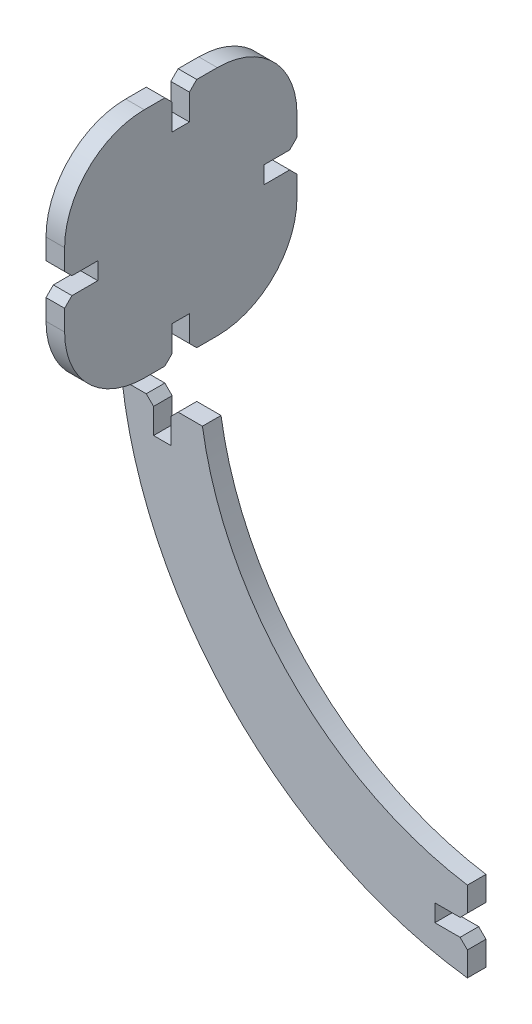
ISO-10303-21;
HEADER;
FILE_DESCRIPTION(('STEP AP214'),'2;1');
FILE_NAME('part.step','',(''),(''),'','','');
FILE_SCHEMA(('AUTOMOTIVE_DESIGN { 1 0 10303 214 1 1 1 1 }'));
ENDSEC;
DATA;
#1=APPLICATION_CONTEXT('core data for automotive mechanical design processes');
#2=APPLICATION_PROTOCOL_DEFINITION('international standard','automotive_design',2000,#1);
#3=PRODUCT_CONTEXT('',#1,'mechanical');
#4=PRODUCT('Part','Part','',(#3));
#5=PRODUCT_RELATED_PRODUCT_CATEGORY('part','',(#4));
#6=PRODUCT_DEFINITION_FORMATION('','',#4);
#7=PRODUCT_DEFINITION_CONTEXT('part definition',#1,'design');
#8=PRODUCT_DEFINITION('design','',#6,#7);
#9=PRODUCT_DEFINITION_SHAPE('','',#8);
#10=(LENGTH_UNIT() NAMED_UNIT(*) SI_UNIT(.MILLI.,.METRE.));
#11=(NAMED_UNIT(*) PLANE_ANGLE_UNIT() SI_UNIT($,.RADIAN.));
#12=(NAMED_UNIT(*) SI_UNIT($,.STERADIAN.) SOLID_ANGLE_UNIT());
#13=UNCERTAINTY_MEASURE_WITH_UNIT(LENGTH_MEASURE(1.E-05),#10,'distance_accuracy_value','');
#14=(GEOMETRIC_REPRESENTATION_CONTEXT(3) GLOBAL_UNCERTAINTY_ASSIGNED_CONTEXT((#13)) GLOBAL_UNIT_ASSIGNED_CONTEXT((#10,
#11,#12)) REPRESENTATION_CONTEXT('',''));
#15=CARTESIAN_POINT('',(0.,0.,0.));
#16=DIRECTION('',(0.,0.,1.));
#17=DIRECTION('',(1.,0.,0.));
#18=AXIS2_PLACEMENT_3D('',#15,#16,#17);
#19=CARTESIAN_POINT('',(-7.49999999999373,-75.9999999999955,-20.9830787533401));
#20=DIRECTION('',(-1.,0.,0.));
#21=DIRECTION('',(0.,-1.,0.));
#22=AXIS2_PLACEMENT_3D('',#19,#20,#21);
#23=PLANE('',#22);
#24=DIRECTION('',(0.,-1.,0.));
#25=VECTOR('',#24,1.);
#26=CARTESIAN_POINT('',(-7.49999999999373,-75.9999999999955,1.4));
#27=LINE('',#26,#25);
#28=CARTESIAN_POINT('',(-7.49999999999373,-63.4104418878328,1.4));
#29=VERTEX_POINT('',#28);
#30=CARTESIAN_POINT('',(-7.49999999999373,-67.0699231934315,1.4));
#31=VERTEX_POINT('',#30);
#32=EDGE_CURVE('E298',#29,#31,#27,.T.);
#33=ORIENTED_EDGE('',*,*,#32,.T.);
#34=DIRECTION('',(0.,0.,-1.));
#35=VECTOR('',#34,1.);
#36=CARTESIAN_POINT('',(-7.49999999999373,-67.0699231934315,-20.9830787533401));
#37=LINE('',#36,#35);
#38=CARTESIAN_POINT('',(-7.49999999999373,-67.0699231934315,-1.4));
#39=VERTEX_POINT('',#38);
#40=EDGE_CURVE('E151',#31,#39,#37,.T.);
#41=ORIENTED_EDGE('',*,*,#40,.T.);
#42=DIRECTION('',(0.,1.,0.));
#43=VECTOR('',#42,1.);
#44=CARTESIAN_POINT('',(-7.49999999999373,-75.9999999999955,-1.4));
#45=LINE('',#44,#43);
#46=CARTESIAN_POINT('',(-7.50000000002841,-63.4104418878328,-1.4));
#47=VERTEX_POINT('',#46);
#48=EDGE_CURVE('E261',#39,#47,#45,.T.);
#49=ORIENTED_EDGE('',*,*,#48,.T.);
#50=DIRECTION('',(0.,0.,1.));
#51=VECTOR('',#50,1.);
#52=CARTESIAN_POINT('',(-7.49999999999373,-63.4104418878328,-20.9830787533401));
#53=LINE('',#52,#51);
#54=EDGE_CURVE('E292',#47,#29,#53,.T.);
#55=ORIENTED_EDGE('',*,*,#54,.T.);
#56=EDGE_LOOP('',(#33,#41,#49,#55));
#57=FACE_BOUND('',#56,.T.);
#58=ADVANCED_FACE('F52',(#57),#23,.F.);
#59=CARTESIAN_POINT('',(-60.,-23.5,-20.9830787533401));
#60=DIRECTION('',(0.,-1.,0.));
#61=DIRECTION('',(0.,0.,-1.));
#62=AXIS2_PLACEMENT_3D('',#59,#60,#61);
#63=PLANE('',#62);
#64=DIRECTION('',(1.,0.,0.));
#65=VECTOR('',#64,1.);
#66=CARTESIAN_POINT('',(-60.,-23.5,1.4));
#67=LINE('',#66,#65);
#68=CARTESIAN_POINT('',(-59.5294044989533,-23.5,1.4));
#69=VERTEX_POINT('',#68);
#70=CARTESIAN_POINT('',(-55.8699231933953,-23.5,1.4));
#71=VERTEX_POINT('',#70);
#72=EDGE_CURVE('E171',#69,#71,#67,.T.);
#73=ORIENTED_EDGE('',*,*,#72,.T.);
#74=DIRECTION('',(0.,0.,-1.));
#75=VECTOR('',#74,1.);
#76=CARTESIAN_POINT('',(-55.8699231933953,-23.5,-20.9830787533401));
#77=LINE('',#76,#75);
#78=CARTESIAN_POINT('',(-55.8699231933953,-23.5,-1.4));
#79=VERTEX_POINT('',#78);
#80=EDGE_CURVE('E163',#71,#79,#77,.T.);
#81=ORIENTED_EDGE('',*,*,#80,.T.);
#82=DIRECTION('',(-1.,0.,0.));
#83=VECTOR('',#82,1.);
#84=CARTESIAN_POINT('',(-60.,-23.5,-1.4));
#85=LINE('',#84,#83);
#86=CARTESIAN_POINT('',(-59.5294044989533,-23.5,-1.4));
#87=VERTEX_POINT('',#86);
#88=EDGE_CURVE('E168',#79,#87,#85,.T.);
#89=ORIENTED_EDGE('',*,*,#88,.T.);
#90=DIRECTION('',(0.,0.,-1.));
#91=VECTOR('',#90,1.);
#92=CARTESIAN_POINT('',(-59.5294044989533,-23.5,1.4));
#93=LINE('',#92,#91);
#94=EDGE_CURVE('E252',#69,#87,#93,.T.);
#95=ORIENTED_EDGE('',*,*,#94,.F.);
#96=EDGE_LOOP('',(#73,#81,#89,#95));
#97=FACE_BOUND('',#96,.T.);
#98=ADVANCED_FACE('F165',(#97),#63,.F.);
#99=CARTESIAN_POINT('',(0.,-16.,1.4));
#100=DIRECTION('',(0.,0.,-1.));
#101=DIRECTION('',(-1.,0.,0.));
#102=AXIS2_PLACEMENT_3D('',#99,#100,#101);
#103=CYLINDRICAL_SURFACE('',#102,48.);
#104=DIRECTION('',(0.,0.,1.));
#105=VECTOR('',#104,1.);
#106=CARTESIAN_POINT('',(-47.4104418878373,-23.5,-20.9830787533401));
#107=LINE('',#106,#105);
#108=CARTESIAN_POINT('',(-47.4104418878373,-23.5,-1.4));
#109=VERTEX_POINT('',#108);
#110=CARTESIAN_POINT('',(-47.4104418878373,-23.5,1.4));
#111=VERTEX_POINT('',#110);
#112=EDGE_CURVE('E239',#109,#111,#107,.T.);
#113=ORIENTED_EDGE('',*,*,#112,.T.);
#114=CARTESIAN_POINT('',(0.,-16.,1.4));
#115=DIRECTION('',(0.,0.,1.));
#116=DIRECTION('',(1.,0.,0.));
#117=AXIS2_PLACEMENT_3D('',#114,#115,#116);
#118=CIRCLE('',#117,48.);
#119=EDGE_CURVE('E244',#111,#29,#118,.T.);
#120=ORIENTED_EDGE('',*,*,#119,.T.);
#121=ORIENTED_EDGE('',*,*,#54,.F.);
#122=CARTESIAN_POINT('',(0.,-16.,-1.4));
#123=DIRECTION('',(0.,0.,1.));
#124=DIRECTION('',(1.,0.,0.));
#125=AXIS2_PLACEMENT_3D('',#122,#123,#124);
#126=CIRCLE('',#125,48.);
#127=EDGE_CURVE('E262',#109,#47,#126,.T.);
#128=ORIENTED_EDGE('',*,*,#127,.F.);
#129=EDGE_LOOP('',(#113,#120,#121,#128));
#130=FACE_BOUND('',#129,.T.);
#131=ADVANCED_FACE('F321',(#130),#103,.F.);
#132=CARTESIAN_POINT('',(0.,-16.,1.4));
#133=DIRECTION('',(0.,0.,-1.));
#134=DIRECTION('',(-1.,0.,0.));
#135=AXIS2_PLACEMENT_3D('',#132,#133,#134);
#136=CYLINDRICAL_SURFACE('',#135,60.);
#137=CARTESIAN_POINT('',(0.,-16.,1.4));
#138=DIRECTION('',(0.,0.,1.));
#139=DIRECTION('',(1.,0.,0.));
#140=AXIS2_PLACEMENT_3D('',#137,#138,#139);
#141=CIRCLE('',#140,60.);
#142=CARTESIAN_POINT('',(-7.49999999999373,-75.5294044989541,1.4));
#143=VERTEX_POINT('',#142);
#144=EDGE_CURVE('E258',#69,#143,#141,.T.);
#145=ORIENTED_EDGE('',*,*,#144,.F.);
#146=ORIENTED_EDGE('',*,*,#94,.T.);
#147=CARTESIAN_POINT('',(0.,-16.,-1.4));
#148=DIRECTION('',(0.,0.,1.));
#149=DIRECTION('',(1.,0.,0.));
#150=AXIS2_PLACEMENT_3D('',#147,#148,#149);
#151=CIRCLE('',#150,60.);
#152=CARTESIAN_POINT('',(-7.49999999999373,-75.5294044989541,-1.4));
#153=VERTEX_POINT('',#152);
#154=EDGE_CURVE('E184',#87,#153,#151,.T.);
#155=ORIENTED_EDGE('',*,*,#154,.T.);
#156=DIRECTION('',(0.,0.,-1.));
#157=VECTOR('',#156,1.);
#158=CARTESIAN_POINT('',(-7.49999999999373,-75.5294044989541,1.4));
#159=LINE('',#158,#157);
#160=EDGE_CURVE('E265',#153,#143,#159,.F.);
#161=ORIENTED_EDGE('',*,*,#160,.T.);
#162=EDGE_LOOP('',(#145,#146,#155,#161));
#163=FACE_BOUND('',#162,.T.);
#164=ADVANCED_FACE('F306',(#163),#136,.T.);
#165=CARTESIAN_POINT('',(0.,-16.,-1.4));
#166=DIRECTION('',(0.,0.,1.));
#167=DIRECTION('',(1.,0.,0.));
#168=AXIS2_PLACEMENT_3D('',#165,#166,#167);
#169=PLANE('',#168);
#170=DIRECTION('',(-1.,0.,0.));
#171=VECTOR('',#170,1.);
#172=CARTESIAN_POINT('',(-7.49999999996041,-70.7699231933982,-1.4));
#173=LINE('',#172,#171);
#174=CARTESIAN_POINT('',(-8.59999999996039,-70.7699231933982,-1.4));
#175=VERTEX_POINT('',#174);
#176=CARTESIAN_POINT('',(-12.3999999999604,-70.7699231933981,-1.4));
#177=VERTEX_POINT('',#176);
#178=EDGE_CURVE('E228',#175,#177,#173,.T.);
#179=ORIENTED_EDGE('',*,*,#178,.F.);
#180=DIRECTION('',(-0.707106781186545,0.707106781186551,0.));
#181=VECTOR('',#180,1.);
#182=CARTESIAN_POINT('',(-7.49999999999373,-71.8699231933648,-1.4));
#183=LINE('',#182,#181);
#184=CARTESIAN_POINT('',(-7.49999999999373,-71.8699231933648,-1.4));
#185=VERTEX_POINT('',#184);
#186=EDGE_CURVE('E191',#175,#185,#183,.F.);
#187=ORIENTED_EDGE('',*,*,#186,.T.);
#188=EDGE_CURVE('E286',#153,#185,#45,.T.);
#189=ORIENTED_EDGE('',*,*,#188,.F.);
#190=ORIENTED_EDGE('',*,*,#154,.F.);
#191=ORIENTED_EDGE('',*,*,#88,.F.);
#192=DIRECTION('',(-0.707106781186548,0.707106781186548,0.));
#193=VECTOR('',#192,1.);
#194=CARTESIAN_POINT('',(-54.8699231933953,-24.5,-1.4));
#195=LINE('',#194,#193);
#196=CARTESIAN_POINT('',(-54.7699231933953,-24.6,-1.4));
#197=VERTEX_POINT('',#196);
#198=EDGE_CURVE('E180',#79,#197,#195,.F.);
#199=ORIENTED_EDGE('',*,*,#198,.T.);
#200=DIRECTION('',(0.,1.,0.));
#201=VECTOR('',#200,1.);
#202=CARTESIAN_POINT('',(-54.7699231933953,-28.5,-1.4));
#203=LINE('',#202,#201);
#204=CARTESIAN_POINT('',(-54.7699231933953,-28.4,-1.4));
#205=VERTEX_POINT('',#204);
#206=EDGE_CURVE('E205',#205,#197,#203,.T.);
#207=ORIENTED_EDGE('',*,*,#206,.F.);
#208=DIRECTION('',(-1.,0.,0.));
#209=VECTOR('',#208,1.);
#210=CARTESIAN_POINT('',(-54.8699231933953,-28.4,-1.4));
#211=LINE('',#210,#209);
#212=CARTESIAN_POINT('',(-52.1699231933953,-28.4,-1.4));
#213=VERTEX_POINT('',#212);
#214=EDGE_CURVE('E209',#213,#205,#211,.T.);
#215=ORIENTED_EDGE('',*,*,#214,.F.);
#216=DIRECTION('',(0.,-1.,0.));
#217=VECTOR('',#216,1.);
#218=CARTESIAN_POINT('',(-52.1699231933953,-28.5,-1.4));
#219=LINE('',#218,#217);
#220=CARTESIAN_POINT('',(-52.1699231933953,-24.6,-1.4));
#221=VERTEX_POINT('',#220);
#222=EDGE_CURVE('E211',#221,#213,#219,.T.);
#223=ORIENTED_EDGE('',*,*,#222,.F.);
#224=DIRECTION('',(-0.70710678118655,-0.707106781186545,0.));
#225=VECTOR('',#224,1.);
#226=CARTESIAN_POINT('',(-51.0699231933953,-23.5,-1.4));
#227=LINE('',#226,#225);
#228=CARTESIAN_POINT('',(-51.0699231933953,-23.5,-1.4));
#229=VERTEX_POINT('',#228);
#230=EDGE_CURVE('E71',#221,#229,#227,.F.);
#231=ORIENTED_EDGE('',*,*,#230,.T.);
#232=EDGE_CURVE('E185',#109,#229,#85,.T.);
#233=ORIENTED_EDGE('',*,*,#232,.F.);
#234=ORIENTED_EDGE('',*,*,#127,.T.);
#235=ORIENTED_EDGE('',*,*,#48,.F.);
#236=DIRECTION('',(0.707106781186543,0.707106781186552,0.));
#237=VECTOR('',#236,1.);
#238=CARTESIAN_POINT('',(-8.49999999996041,-68.0699231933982,-1.4));
#239=LINE('',#238,#237);
#240=CARTESIAN_POINT('',(-8.59999999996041,-68.1699231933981,-1.4));
#241=VERTEX_POINT('',#240);
#242=EDGE_CURVE('E156',#39,#241,#239,.F.);
#243=ORIENTED_EDGE('',*,*,#242,.T.);
#244=DIRECTION('',(1.,0.,0.));
#245=VECTOR('',#244,1.);
#246=CARTESIAN_POINT('',(-7.49999999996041,-68.1699231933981,-1.4));
#247=LINE('',#246,#245);
#248=CARTESIAN_POINT('',(-12.3999999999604,-68.1699231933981,-1.4));
#249=VERTEX_POINT('',#248);
#250=EDGE_CURVE('E229',#249,#241,#247,.T.);
#251=ORIENTED_EDGE('',*,*,#250,.F.);
#252=DIRECTION('',(0.,1.,0.));
#253=VECTOR('',#252,1.);
#254=CARTESIAN_POINT('',(-12.3999999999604,-68.0699231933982,-1.4));
#255=LINE('',#254,#253);
#256=EDGE_CURVE('E219',#177,#249,#255,.T.);
#257=ORIENTED_EDGE('',*,*,#256,.F.);
#258=EDGE_LOOP('',(#179,#187,#189,#190,#191,#199,#207,#215,#223,#231,#233,#234,#235,#243,#251,#257));
#259=FACE_BOUND('',#258,.T.);
#260=ADVANCED_FACE('F178',(#259),#169,.F.);
#261=CARTESIAN_POINT('',(0.,-16.,1.4));
#262=DIRECTION('',(0.,0.,1.));
#263=DIRECTION('',(1.,0.,0.));
#264=AXIS2_PLACEMENT_3D('',#261,#262,#263);
#265=PLANE('',#264);
#266=CARTESIAN_POINT('',(-7.49999999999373,-71.8699231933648,1.4));
#267=VERTEX_POINT('',#266);
#268=EDGE_CURVE('E279',#267,#143,#27,.T.);
#269=ORIENTED_EDGE('',*,*,#268,.F.);
#270=DIRECTION('',(0.707106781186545,-0.707106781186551,0.));
#271=VECTOR('',#270,1.);
#272=CARTESIAN_POINT('',(-31.6849615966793,-47.684961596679,1.4));
#273=LINE('',#272,#271);
#274=CARTESIAN_POINT('',(-8.5999999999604,-70.7699231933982,1.4));
#275=VERTEX_POINT('',#274);
#276=EDGE_CURVE('E137',#267,#275,#273,.F.);
#277=ORIENTED_EDGE('',*,*,#276,.T.);
#278=DIRECTION('',(1.,0.,0.));
#279=VECTOR('',#278,1.);
#280=CARTESIAN_POINT('',(-1.52017074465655E-13,-70.7699231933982,1.4));
#281=LINE('',#280,#279);
#282=CARTESIAN_POINT('',(-12.3999999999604,-70.7699231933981,1.4));
#283=VERTEX_POINT('',#282);
#284=EDGE_CURVE('E225',#283,#275,#281,.T.);
#285=ORIENTED_EDGE('',*,*,#284,.F.);
#286=DIRECTION('',(0.,-1.,0.));
#287=VECTOR('',#286,1.);
#288=CARTESIAN_POINT('',(-12.3999999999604,-16.,1.4));
#289=LINE('',#288,#287);
#290=CARTESIAN_POINT('',(-12.3999999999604,-68.1699231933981,1.4));
#291=VERTEX_POINT('',#290);
#292=EDGE_CURVE('E236',#291,#283,#289,.T.);
#293=ORIENTED_EDGE('',*,*,#292,.F.);
#294=DIRECTION('',(-1.,0.,0.));
#295=VECTOR('',#294,1.);
#296=CARTESIAN_POINT('',(0.,-68.1699231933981,1.4));
#297=LINE('',#296,#295);
#298=CARTESIAN_POINT('',(-8.59999999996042,-68.1699231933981,1.4));
#299=VERTEX_POINT('',#298);
#300=EDGE_CURVE('E238',#299,#291,#297,.T.);
#301=ORIENTED_EDGE('',*,*,#300,.F.);
#302=DIRECTION('',(-0.707106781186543,-0.707106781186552,0.));
#303=VECTOR('',#302,1.);
#304=CARTESIAN_POINT('',(21.7849615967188,-37.7849615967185,1.4));
#305=LINE('',#304,#303);
#306=EDGE_CURVE('E128',#299,#31,#305,.F.);
#307=ORIENTED_EDGE('',*,*,#306,.T.);
#308=ORIENTED_EDGE('',*,*,#32,.F.);
#309=ORIENTED_EDGE('',*,*,#119,.F.);
#310=CARTESIAN_POINT('',(-51.0699231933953,-23.5,1.4));
#311=VERTEX_POINT('',#310);
#312=EDGE_CURVE('E257',#311,#111,#67,.T.);
#313=ORIENTED_EDGE('',*,*,#312,.F.);
#314=DIRECTION('',(0.70710678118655,0.707106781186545,0.));
#315=VECTOR('',#314,1.);
#316=CARTESIAN_POINT('',(-21.7849615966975,5.78496159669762,1.4));
#317=LINE('',#316,#315);
#318=CARTESIAN_POINT('',(-52.1699231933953,-24.6,1.4));
#319=VERTEX_POINT('',#318);
#320=EDGE_CURVE('E269',#311,#319,#317,.F.);
#321=ORIENTED_EDGE('',*,*,#320,.T.);
#322=DIRECTION('',(0.,1.,0.));
#323=VECTOR('',#322,1.);
#324=CARTESIAN_POINT('',(-52.1699231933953,-15.9999999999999,1.4));
#325=LINE('',#324,#323);
#326=CARTESIAN_POINT('',(-52.1699231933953,-28.4,1.4));
#327=VERTEX_POINT('',#326);
#328=EDGE_CURVE('E213',#327,#319,#325,.T.);
#329=ORIENTED_EDGE('',*,*,#328,.F.);
#330=DIRECTION('',(1.,0.,0.));
#331=VECTOR('',#330,1.);
#332=CARTESIAN_POINT('',(0.,-28.4,1.4));
#333=LINE('',#332,#331);
#334=CARTESIAN_POINT('',(-54.7699231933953,-28.4,1.4));
#335=VERTEX_POINT('',#334);
#336=EDGE_CURVE('E216',#335,#327,#333,.T.);
#337=ORIENTED_EDGE('',*,*,#336,.F.);
#338=DIRECTION('',(0.,-1.,0.));
#339=VECTOR('',#338,1.);
#340=CARTESIAN_POINT('',(-54.7699231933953,-16.,1.4));
#341=LINE('',#340,#339);
#342=CARTESIAN_POINT('',(-54.7699231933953,-24.6,1.4));
#343=VERTEX_POINT('',#342);
#344=EDGE_CURVE('E207',#343,#335,#341,.T.);
#345=ORIENTED_EDGE('',*,*,#344,.F.);
#346=DIRECTION('',(0.707106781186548,-0.707106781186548,0.));
#347=VECTOR('',#346,1.);
#348=CARTESIAN_POINT('',(-31.6849615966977,-47.6849615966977,1.4));
#349=LINE('',#348,#347);
#350=EDGE_CURVE('E271',#343,#71,#349,.F.);
#351=ORIENTED_EDGE('',*,*,#350,.T.);
#352=ORIENTED_EDGE('',*,*,#72,.F.);
#353=ORIENTED_EDGE('',*,*,#144,.T.);
#354=EDGE_LOOP('',(#269,#277,#285,#293,#301,#307,#308,#309,#313,#321,#329,#337,#345,#351,#352,#353));
#355=FACE_BOUND('',#354,.T.);
#356=ADVANCED_FACE('F276',(#355),#265,.T.);
#357=ORIENTED_EDGE('',*,*,#188,.T.);
#358=DIRECTION('',(0.,0.,1.));
#359=VECTOR('',#358,1.);
#360=CARTESIAN_POINT('',(-7.49999999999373,-71.8699231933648,-20.9830787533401));
#361=LINE('',#360,#359);
#362=EDGE_CURVE('E267',#185,#267,#361,.T.);
#363=ORIENTED_EDGE('',*,*,#362,.T.);
#364=ORIENTED_EDGE('',*,*,#268,.T.);
#365=ORIENTED_EDGE('',*,*,#160,.F.);
#366=EDGE_LOOP('',(#357,#363,#364,#365));
#367=FACE_BOUND('',#366,.T.);
#368=ADVANCED_FACE('F290',(#367),#23,.F.);
#369=ORIENTED_EDGE('',*,*,#232,.T.);
#370=DIRECTION('',(0.,0.,1.));
#371=VECTOR('',#370,1.);
#372=CARTESIAN_POINT('',(-51.0699231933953,-23.5,-20.9830787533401));
#373=LINE('',#372,#371);
#374=EDGE_CURVE('E62',#229,#311,#373,.T.);
#375=ORIENTED_EDGE('',*,*,#374,.T.);
#376=ORIENTED_EDGE('',*,*,#312,.T.);
#377=ORIENTED_EDGE('',*,*,#112,.F.);
#378=EDGE_LOOP('',(#369,#375,#376,#377));
#379=FACE_BOUND('',#378,.T.);
#380=ADVANCED_FACE('F317',(#379),#63,.F.);
#381=CARTESIAN_POINT('',(-54.8699231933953,-28.4,-7.13061951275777));
#382=DIRECTION('',(0.,-1.,0.));
#383=DIRECTION('',(1.,0.,0.));
#384=AXIS2_PLACEMENT_3D('',#381,#382,#383);
#385=PLANE('',#384);
#386=ORIENTED_EDGE('',*,*,#214,.T.);
#387=DIRECTION('',(0.,0.,1.));
#388=VECTOR('',#387,1.);
#389=CARTESIAN_POINT('',(-54.7699231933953,-28.4,-7.13061951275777));
#390=LINE('',#389,#388);
#391=EDGE_CURVE('E201',#205,#335,#390,.T.);
#392=ORIENTED_EDGE('',*,*,#391,.T.);
#393=ORIENTED_EDGE('',*,*,#336,.T.);
#394=DIRECTION('',(0.,0.,1.));
#395=VECTOR('',#394,1.);
#396=CARTESIAN_POINT('',(-52.1699231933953,-28.4,-7.13061951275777));
#397=LINE('',#396,#395);
#398=EDGE_CURVE('E204',#213,#327,#397,.T.);
#399=ORIENTED_EDGE('',*,*,#398,.F.);
#400=EDGE_LOOP('',(#386,#392,#393,#399));
#401=FACE_BOUND('',#400,.T.);
#402=ADVANCED_FACE('F331',(#401),#385,.F.);
#403=CARTESIAN_POINT('',(-54.7699231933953,-28.5,-7.13061951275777));
#404=DIRECTION('',(-1.,0.,0.));
#405=DIRECTION('',(0.,0.,1.));
#406=AXIS2_PLACEMENT_3D('',#403,#404,#405);
#407=PLANE('',#406);
#408=ORIENTED_EDGE('',*,*,#206,.T.);
#409=DIRECTION('',(0.,0.,-1.));
#410=VECTOR('',#409,1.);
#411=CARTESIAN_POINT('',(-54.7699231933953,-24.6,-7.13061951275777));
#412=LINE('',#411,#410);
#413=EDGE_CURVE('E174',#197,#343,#412,.F.);
#414=ORIENTED_EDGE('',*,*,#413,.T.);
#415=ORIENTED_EDGE('',*,*,#344,.T.);
#416=ORIENTED_EDGE('',*,*,#391,.F.);
#417=EDGE_LOOP('',(#408,#414,#415,#416));
#418=FACE_BOUND('',#417,.T.);
#419=ADVANCED_FACE('F334',(#418),#407,.F.);
#420=CARTESIAN_POINT('',(-52.1699231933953,-28.5,-7.13061951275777));
#421=DIRECTION('',(1.,0.,0.));
#422=DIRECTION('',(0.,1.,0.));
#423=AXIS2_PLACEMENT_3D('',#420,#421,#422);
#424=PLANE('',#423);
#425=ORIENTED_EDGE('',*,*,#328,.T.);
#426=DIRECTION('',(0.,0.,1.));
#427=VECTOR('',#426,1.);
#428=CARTESIAN_POINT('',(-52.1699231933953,-24.6,-20.9830787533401));
#429=LINE('',#428,#427);
#430=EDGE_CURVE('E13',#319,#221,#429,.F.);
#431=ORIENTED_EDGE('',*,*,#430,.T.);
#432=ORIENTED_EDGE('',*,*,#222,.T.);
#433=ORIENTED_EDGE('',*,*,#398,.T.);
#434=EDGE_LOOP('',(#425,#431,#432,#433));
#435=FACE_BOUND('',#434,.T.);
#436=ADVANCED_FACE('F326',(#435),#424,.F.);
#437=CARTESIAN_POINT('',(-7.49999999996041,-68.1699231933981,-7.13061951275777));
#438=DIRECTION('',(0.,1.,0.));
#439=DIRECTION('',(-1.,0.,0.));
#440=AXIS2_PLACEMENT_3D('',#437,#438,#439);
#441=PLANE('',#440);
#442=ORIENTED_EDGE('',*,*,#250,.T.);
#443=DIRECTION('',(0.,0.,-1.));
#444=VECTOR('',#443,1.);
#445=CARTESIAN_POINT('',(-8.59999999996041,-68.1699231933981,-7.13061951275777));
#446=LINE('',#445,#444);
#447=EDGE_CURVE('E56',#241,#299,#446,.F.);
#448=ORIENTED_EDGE('',*,*,#447,.T.);
#449=ORIENTED_EDGE('',*,*,#300,.T.);
#450=DIRECTION('',(0.,0.,1.));
#451=VECTOR('',#450,1.);
#452=CARTESIAN_POINT('',(-12.3999999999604,-68.1699231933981,-7.13061951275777));
#453=LINE('',#452,#451);
#454=EDGE_CURVE('E222',#249,#291,#453,.T.);
#455=ORIENTED_EDGE('',*,*,#454,.F.);
#456=EDGE_LOOP('',(#442,#448,#449,#455));
#457=FACE_BOUND('',#456,.T.);
#458=ADVANCED_FACE('F341',(#457),#441,.F.);
#459=CARTESIAN_POINT('',(-7.49999999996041,-70.7699231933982,-7.13061951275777));
#460=DIRECTION('',(0.,-1.,0.));
#461=DIRECTION('',(1.,0.,0.));
#462=AXIS2_PLACEMENT_3D('',#459,#460,#461);
#463=PLANE('',#462);
#464=ORIENTED_EDGE('',*,*,#284,.T.);
#465=DIRECTION('',(0.,0.,1.));
#466=VECTOR('',#465,1.);
#467=CARTESIAN_POINT('',(-8.59999999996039,-70.7699231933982,-20.9830787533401));
#468=LINE('',#467,#466);
#469=EDGE_CURVE('E193',#275,#175,#468,.F.);
#470=ORIENTED_EDGE('',*,*,#469,.T.);
#471=ORIENTED_EDGE('',*,*,#178,.T.);
#472=DIRECTION('',(0.,0.,1.));
#473=VECTOR('',#472,1.);
#474=CARTESIAN_POINT('',(-12.3999999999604,-70.7699231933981,-7.13061951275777));
#475=LINE('',#474,#473);
#476=EDGE_CURVE('E226',#177,#283,#475,.T.);
#477=ORIENTED_EDGE('',*,*,#476,.T.);
#478=EDGE_LOOP('',(#464,#470,#471,#477));
#479=FACE_BOUND('',#478,.T.);
#480=ADVANCED_FACE('F54',(#479),#463,.F.);
#481=CARTESIAN_POINT('',(-12.3999999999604,-68.0699231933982,-7.13061951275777));
#482=DIRECTION('',(-1.,0.,0.));
#483=DIRECTION('',(0.,0.,1.));
#484=AXIS2_PLACEMENT_3D('',#481,#482,#483);
#485=PLANE('',#484);
#486=ORIENTED_EDGE('',*,*,#256,.T.);
#487=ORIENTED_EDGE('',*,*,#454,.T.);
#488=ORIENTED_EDGE('',*,*,#292,.T.);
#489=ORIENTED_EDGE('',*,*,#476,.F.);
#490=EDGE_LOOP('',(#486,#487,#488,#489));
#491=FACE_BOUND('',#490,.T.);
#492=ADVANCED_FACE('F370',(#491),#485,.F.);
#493=CARTESIAN_POINT('',(-7.49999999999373,-71.8699231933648,-20.9830787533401));
#494=DIRECTION('',(-0.707106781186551,-0.707106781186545,0.));
#495=DIRECTION('',(0.,0.,1.));
#496=AXIS2_PLACEMENT_3D('',#493,#494,#495);
#497=PLANE('',#496);
#498=ORIENTED_EDGE('',*,*,#186,.F.);
#499=ORIENTED_EDGE('',*,*,#469,.F.);
#500=ORIENTED_EDGE('',*,*,#276,.F.);
#501=ORIENTED_EDGE('',*,*,#362,.F.);
#502=EDGE_LOOP('',(#498,#499,#500,#501));
#503=FACE_BOUND('',#502,.T.);
#504=ADVANCED_FACE('F283',(#503),#497,.F.);
#505=CARTESIAN_POINT('',(-8.49999999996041,-68.0699231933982,-7.13061951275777));
#506=DIRECTION('',(-0.707106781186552,0.707106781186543,0.));
#507=DIRECTION('',(0.,0.,1.));
#508=AXIS2_PLACEMENT_3D('',#505,#506,#507);
#509=PLANE('',#508);
#510=ORIENTED_EDGE('',*,*,#242,.F.);
#511=ORIENTED_EDGE('',*,*,#40,.F.);
#512=ORIENTED_EDGE('',*,*,#306,.F.);
#513=ORIENTED_EDGE('',*,*,#447,.F.);
#514=EDGE_LOOP('',(#510,#511,#512,#513));
#515=FACE_BOUND('',#514,.T.);
#516=ADVANCED_FACE('F369',(#515),#509,.F.);
#517=CARTESIAN_POINT('',(-54.8699231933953,-24.5,-7.13061951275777));
#518=DIRECTION('',(-0.707106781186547,-0.707106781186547,0.));
#519=DIRECTION('',(0.,0.,1.));
#520=AXIS2_PLACEMENT_3D('',#517,#518,#519);
#521=PLANE('',#520);
#522=ORIENTED_EDGE('',*,*,#198,.F.);
#523=ORIENTED_EDGE('',*,*,#80,.F.);
#524=ORIENTED_EDGE('',*,*,#350,.F.);
#525=ORIENTED_EDGE('',*,*,#413,.F.);
#526=EDGE_LOOP('',(#522,#523,#524,#525));
#527=FACE_BOUND('',#526,.T.);
#528=ADVANCED_FACE('F188',(#527),#521,.F.);
#529=CARTESIAN_POINT('',(-51.0699231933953,-23.5,-20.9830787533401));
#530=DIRECTION('',(0.707106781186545,-0.70710678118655,0.));
#531=DIRECTION('',(0.,0.,1.));
#532=AXIS2_PLACEMENT_3D('',#529,#530,#531);
#533=PLANE('',#532);
#534=ORIENTED_EDGE('',*,*,#230,.F.);
#535=ORIENTED_EDGE('',*,*,#430,.F.);
#536=ORIENTED_EDGE('',*,*,#320,.F.);
#537=ORIENTED_EDGE('',*,*,#374,.F.);
#538=EDGE_LOOP('',(#534,#535,#536,#537));
#539=FACE_BOUND('',#538,.T.);
#540=ADVANCED_FACE('F323',(#539),#533,.F.);
#541=CLOSED_SHELL('',(#58,#98,#131,#164,#260,#356,#368,#380,#402,#419,#436,#458,#480,#492,#504,
#516,#528,#540));
#542=MANIFOLD_SOLID_BREP('B2',#541);
#543=CARTESIAN_POINT('',(-104.367397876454,-17.4999999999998,17.5));
#544=DIRECTION('',(0.,0.,-1.));
#545=DIRECTION('',(-1.,0.,0.));
#546=AXIS2_PLACEMENT_3D('',#543,#544,#545);
#547=PLANE('',#546);
#548=DIRECTION('',(0.,1.,0.));
#549=VECTOR('',#548,1.);
#550=CARTESIAN_POINT('',(-52.0699231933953,-17.4999999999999,17.5));
#551=LINE('',#550,#549);
#552=CARTESIAN_POINT('',(-52.0699231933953,-5.49999999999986,17.5));
#553=VERTEX_POINT('',#552);
#554=CARTESIAN_POINT('',(-52.0699231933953,-2.3999999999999,17.5));
#555=VERTEX_POINT('',#554);
#556=EDGE_CURVE('E714',#553,#555,#551,.T.);
#557=ORIENTED_EDGE('',*,*,#556,.T.);
#558=DIRECTION('',(-1.,0.,0.));
#559=VECTOR('',#558,1.);
#560=CARTESIAN_POINT('',(-104.367397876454,-2.3999999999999,17.5));
#561=LINE('',#560,#559);
#562=CARTESIAN_POINT('',(-54.8699231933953,-2.3999999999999,17.5));
#563=VERTEX_POINT('',#562);
#564=EDGE_CURVE('E837',#555,#563,#561,.T.);
#565=ORIENTED_EDGE('',*,*,#564,.T.);
#566=DIRECTION('',(0.,1.,0.));
#567=VECTOR('',#566,1.);
#568=CARTESIAN_POINT('',(-54.8699231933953,-17.4999999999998,17.5));
#569=LINE('',#568,#567);
#570=CARTESIAN_POINT('',(-54.8699231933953,-5.49999999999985,17.5));
#571=VERTEX_POINT('',#570);
#572=EDGE_CURVE('E726',#571,#563,#569,.T.);
#573=ORIENTED_EDGE('',*,*,#572,.F.);
#574=DIRECTION('',(1.,0.,0.));
#575=VECTOR('',#574,1.);
#576=CARTESIAN_POINT('',(-104.367397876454,-5.49999999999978,17.5));
#577=LINE('',#576,#575);
#578=EDGE_CURVE('E768',#571,#553,#577,.T.);
#579=ORIENTED_EDGE('',*,*,#578,.T.);
#580=EDGE_LOOP('',(#557,#565,#573,#579));
#581=FACE_BOUND('',#580,.T.);
#582=ADVANCED_FACE('F529',(#581),#547,.F.);
#583=CARTESIAN_POINT('',(-104.367397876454,-17.4999999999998,-17.5));
#584=DIRECTION('',(0.,0.,1.));
#585=DIRECTION('',(1.,0.,0.));
#586=AXIS2_PLACEMENT_3D('',#583,#584,#585);
#587=PLANE('',#586);
#588=DIRECTION('',(0.,-1.,0.));
#589=VECTOR('',#588,1.);
#590=CARTESIAN_POINT('',(-52.0699231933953,-17.4999999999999,-17.5));
#591=LINE('',#590,#589);
#592=CARTESIAN_POINT('',(-52.0699231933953,5.50000000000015,-17.5));
#593=VERTEX_POINT('',#592);
#594=CARTESIAN_POINT('',(-52.0699231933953,2.40000000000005,-17.5));
#595=VERTEX_POINT('',#594);
#596=EDGE_CURVE('E706',#593,#595,#591,.T.);
#597=ORIENTED_EDGE('',*,*,#596,.T.);
#598=DIRECTION('',(-1.,0.,0.));
#599=VECTOR('',#598,1.);
#600=CARTESIAN_POINT('',(-104.367397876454,2.40000000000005,-17.5));
#601=LINE('',#600,#599);
#602=CARTESIAN_POINT('',(-54.8699231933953,2.40000000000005,-17.5));
#603=VERTEX_POINT('',#602);
#604=EDGE_CURVE('E827',#595,#603,#601,.T.);
#605=ORIENTED_EDGE('',*,*,#604,.T.);
#606=DIRECTION('',(0.,-1.,0.));
#607=VECTOR('',#606,1.);
#608=CARTESIAN_POINT('',(-54.8699231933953,-17.4999999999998,-17.5));
#609=LINE('',#608,#607);
#610=CARTESIAN_POINT('',(-54.8699231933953,5.50000000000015,-17.5));
#611=VERTEX_POINT('',#610);
#612=EDGE_CURVE('E718',#611,#603,#609,.T.);
#613=ORIENTED_EDGE('',*,*,#612,.F.);
#614=DIRECTION('',(1.,0.,0.));
#615=VECTOR('',#614,1.);
#616=CARTESIAN_POINT('',(-104.367397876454,5.50000000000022,-17.5));
#617=LINE('',#616,#615);
#618=EDGE_CURVE('E721',#611,#593,#617,.T.);
#619=ORIENTED_EDGE('',*,*,#618,.T.);
#620=EDGE_LOOP('',(#597,#605,#613,#619));
#621=FACE_BOUND('',#620,.T.);
#622=ADVANCED_FACE('F1009',(#621),#587,.F.);
#623=CARTESIAN_POINT('',(-104.367397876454,-17.4999999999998,-17.5));
#624=DIRECTION('',(0.,1.,0.));
#625=DIRECTION('',(-1.,0.,0.));
#626=AXIS2_PLACEMENT_3D('',#623,#624,#625);
#627=PLANE('',#626);
#628=DIRECTION('',(0.,0.,1.));
#629=VECTOR('',#628,1.);
#630=CARTESIAN_POINT('',(-52.0699231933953,-17.4999999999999,-17.5));
#631=LINE('',#630,#629);
#632=CARTESIAN_POINT('',(-52.0699231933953,-17.4999999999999,-5.5));
#633=VERTEX_POINT('',#632);
#634=CARTESIAN_POINT('',(-52.0699231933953,-17.4999999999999,-2.39999999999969));
#635=VERTEX_POINT('',#634);
#636=EDGE_CURVE('E701',#633,#635,#631,.T.);
#637=ORIENTED_EDGE('',*,*,#636,.T.);
#638=DIRECTION('',(-1.,0.,0.));
#639=VECTOR('',#638,1.);
#640=CARTESIAN_POINT('',(-104.367397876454,-17.4999999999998,-2.39999999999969));
#641=LINE('',#640,#639);
#642=CARTESIAN_POINT('',(-54.8699231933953,-17.4999999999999,-2.39999999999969));
#643=VERTEX_POINT('',#642);
#644=EDGE_CURVE('E830',#635,#643,#641,.T.);
#645=ORIENTED_EDGE('',*,*,#644,.T.);
#646=DIRECTION('',(0.,0.,1.));
#647=VECTOR('',#646,1.);
#648=CARTESIAN_POINT('',(-54.8699231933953,-17.4999999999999,-17.5));
#649=LINE('',#648,#647);
#650=CARTESIAN_POINT('',(-54.8699231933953,-17.4999999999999,-5.5));
#651=VERTEX_POINT('',#650);
#652=EDGE_CURVE('E730',#651,#643,#649,.T.);
#653=ORIENTED_EDGE('',*,*,#652,.F.);
#654=DIRECTION('',(1.,0.,0.));
#655=VECTOR('',#654,1.);
#656=CARTESIAN_POINT('',(-104.367397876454,-17.4999999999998,-5.5));
#657=LINE('',#656,#655);
#658=EDGE_CURVE('E762',#651,#633,#657,.T.);
#659=ORIENTED_EDGE('',*,*,#658,.T.);
#660=EDGE_LOOP('',(#637,#645,#653,#659));
#661=FACE_BOUND('',#660,.T.);
#662=ADVANCED_FACE('F1032',(#661),#627,.F.);
#663=CARTESIAN_POINT('',(-104.367397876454,17.5000000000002,-17.5));
#664=DIRECTION('',(0.,-1.,0.));
#665=DIRECTION('',(1.,0.,0.));
#666=AXIS2_PLACEMENT_3D('',#663,#664,#665);
#667=PLANE('',#666);
#668=DIRECTION('',(0.,0.,-1.));
#669=VECTOR('',#668,1.);
#670=CARTESIAN_POINT('',(-52.0699231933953,17.5000000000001,-17.5));
#671=LINE('',#670,#669);
#672=CARTESIAN_POINT('',(-52.0699231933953,17.5000000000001,5.5));
#673=VERTEX_POINT('',#672);
#674=CARTESIAN_POINT('',(-52.0699231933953,17.5000000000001,2.39999999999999));
#675=VERTEX_POINT('',#674);
#676=EDGE_CURVE('E710',#673,#675,#671,.T.);
#677=ORIENTED_EDGE('',*,*,#676,.T.);
#678=DIRECTION('',(-1.,0.,0.));
#679=VECTOR('',#678,1.);
#680=CARTESIAN_POINT('',(-104.367397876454,17.5000000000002,2.39999999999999));
#681=LINE('',#680,#679);
#682=CARTESIAN_POINT('',(-54.8699231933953,17.5000000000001,2.39999999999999));
#683=VERTEX_POINT('',#682);
#684=EDGE_CURVE('E780',#675,#683,#681,.T.);
#685=ORIENTED_EDGE('',*,*,#684,.T.);
#686=DIRECTION('',(0.,0.,-1.));
#687=VECTOR('',#686,1.);
#688=CARTESIAN_POINT('',(-54.8699231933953,17.5000000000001,-17.5));
#689=LINE('',#688,#687);
#690=CARTESIAN_POINT('',(-54.8699231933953,17.5000000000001,5.5));
#691=VERTEX_POINT('',#690);
#692=EDGE_CURVE('E723',#691,#683,#689,.T.);
#693=ORIENTED_EDGE('',*,*,#692,.F.);
#694=DIRECTION('',(1.,0.,0.));
#695=VECTOR('',#694,1.);
#696=CARTESIAN_POINT('',(-104.367397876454,17.5000000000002,5.5));
#697=LINE('',#696,#695);
#698=EDGE_CURVE('E774',#691,#673,#697,.T.);
#699=ORIENTED_EDGE('',*,*,#698,.T.);
#700=EDGE_LOOP('',(#677,#685,#693,#699));
#701=FACE_BOUND('',#700,.T.);
#702=ADVANCED_FACE('F928',(#701),#667,.F.);
#703=CARTESIAN_POINT('',(-54.8699231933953,2.39999999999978,17.5));
#704=VERTEX_POINT('',#703);
#705=CARTESIAN_POINT('',(-54.8699231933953,5.50000000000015,17.5));
#706=VERTEX_POINT('',#705);
#707=EDGE_CURVE('E729',#704,#706,#569,.T.);
#708=ORIENTED_EDGE('',*,*,#707,.F.);
#709=DIRECTION('',(1.,0.,0.));
#710=VECTOR('',#709,1.);
#711=CARTESIAN_POINT('',(-104.367397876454,2.39999999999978,17.5));
#712=LINE('',#711,#710);
#713=CARTESIAN_POINT('',(-52.0699231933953,2.39999999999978,17.5));
#714=VERTEX_POINT('',#713);
#715=EDGE_CURVE('E50',#704,#714,#712,.T.);
#716=ORIENTED_EDGE('',*,*,#715,.T.);
#717=CARTESIAN_POINT('',(-52.0699231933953,5.50000000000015,17.5));
#718=VERTEX_POINT('',#717);
#719=EDGE_CURVE('E717',#714,#718,#551,.T.);
#720=ORIENTED_EDGE('',*,*,#719,.T.);
#721=DIRECTION('',(1.,0.,0.));
#722=VECTOR('',#721,1.);
#723=CARTESIAN_POINT('',(-104.367397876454,5.50000000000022,17.5));
#724=LINE('',#723,#722);
#725=EDGE_CURVE('E777',#718,#706,#724,.F.);
#726=ORIENTED_EDGE('',*,*,#725,.T.);
#727=EDGE_LOOP('',(#708,#716,#720,#726));
#728=FACE_BOUND('',#727,.T.);
#729=ADVANCED_FACE('F1081',(#728),#547,.F.);
#730=CARTESIAN_POINT('',(-54.8699231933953,17.5000000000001,-2.4));
#731=VERTEX_POINT('',#730);
#732=CARTESIAN_POINT('',(-54.8699231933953,17.5000000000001,-5.5));
#733=VERTEX_POINT('',#732);
#734=EDGE_CURVE('E725',#731,#733,#689,.T.);
#735=ORIENTED_EDGE('',*,*,#734,.F.);
#736=DIRECTION('',(1.,0.,0.));
#737=VECTOR('',#736,1.);
#738=CARTESIAN_POINT('',(-104.367397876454,17.5000000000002,-2.4));
#739=LINE('',#738,#737);
#740=CARTESIAN_POINT('',(-52.0699231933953,17.5000000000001,-2.4));
#741=VERTEX_POINT('',#740);
#742=EDGE_CURVE('E820',#731,#741,#739,.T.);
#743=ORIENTED_EDGE('',*,*,#742,.T.);
#744=CARTESIAN_POINT('',(-52.0699231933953,17.5000000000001,-5.5));
#745=VERTEX_POINT('',#744);
#746=EDGE_CURVE('E713',#741,#745,#671,.T.);
#747=ORIENTED_EDGE('',*,*,#746,.T.);
#748=DIRECTION('',(1.,0.,0.));
#749=VECTOR('',#748,1.);
#750=CARTESIAN_POINT('',(-104.367397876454,17.5000000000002,-5.5));
#751=LINE('',#750,#749);
#752=EDGE_CURVE('E747',#745,#733,#751,.F.);
#753=ORIENTED_EDGE('',*,*,#752,.T.);
#754=EDGE_LOOP('',(#735,#743,#747,#753));
#755=FACE_BOUND('',#754,.T.);
#756=ADVANCED_FACE('F980',(#755),#667,.F.);
#757=CARTESIAN_POINT('',(-54.8699231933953,-2.39999999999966,-17.5));
#758=VERTEX_POINT('',#757);
#759=CARTESIAN_POINT('',(-54.8699231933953,-5.49999999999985,-17.5));
#760=VERTEX_POINT('',#759);
#761=EDGE_CURVE('E722',#758,#760,#609,.T.);
#762=ORIENTED_EDGE('',*,*,#761,.F.);
#763=DIRECTION('',(1.,0.,0.));
#764=VECTOR('',#763,1.);
#765=CARTESIAN_POINT('',(-104.367397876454,-2.39999999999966,-17.5));
#766=LINE('',#765,#764);
#767=CARTESIAN_POINT('',(-52.0699231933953,-2.39999999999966,-17.5));
#768=VERTEX_POINT('',#767);
#769=EDGE_CURVE('E824',#758,#768,#766,.T.);
#770=ORIENTED_EDGE('',*,*,#769,.T.);
#771=CARTESIAN_POINT('',(-52.0699231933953,-5.49999999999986,-17.5));
#772=VERTEX_POINT('',#771);
#773=EDGE_CURVE('E709',#768,#772,#591,.T.);
#774=ORIENTED_EDGE('',*,*,#773,.T.);
#775=DIRECTION('',(1.,0.,0.));
#776=VECTOR('',#775,1.);
#777=CARTESIAN_POINT('',(-104.367397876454,-5.49999999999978,-17.5));
#778=LINE('',#777,#776);
#779=EDGE_CURVE('E765',#772,#760,#778,.F.);
#780=ORIENTED_EDGE('',*,*,#779,.T.);
#781=EDGE_LOOP('',(#762,#770,#774,#780));
#782=FACE_BOUND('',#781,.T.);
#783=ADVANCED_FACE('F1023',(#782),#587,.F.);
#784=CARTESIAN_POINT('',(-54.8699231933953,-17.4999999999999,2.39999999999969));
#785=VERTEX_POINT('',#784);
#786=CARTESIAN_POINT('',(-54.8699231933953,-17.4999999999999,5.5));
#787=VERTEX_POINT('',#786);
#788=EDGE_CURVE('E704',#785,#787,#649,.T.);
#789=ORIENTED_EDGE('',*,*,#788,.F.);
#790=DIRECTION('',(1.,0.,0.));
#791=VECTOR('',#790,1.);
#792=CARTESIAN_POINT('',(-104.367397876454,-17.4999999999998,2.39999999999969));
#793=LINE('',#792,#791);
#794=CARTESIAN_POINT('',(-52.0699231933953,-17.4999999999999,2.39999999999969));
#795=VERTEX_POINT('',#794);
#796=EDGE_CURVE('E834',#785,#795,#793,.T.);
#797=ORIENTED_EDGE('',*,*,#796,.T.);
#798=CARTESIAN_POINT('',(-52.0699231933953,-17.4999999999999,5.5));
#799=VERTEX_POINT('',#798);
#800=EDGE_CURVE('E705',#795,#799,#631,.T.);
#801=ORIENTED_EDGE('',*,*,#800,.T.);
#802=DIRECTION('',(1.,0.,0.));
#803=VECTOR('',#802,1.);
#804=CARTESIAN_POINT('',(-104.367397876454,-17.4999999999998,5.5));
#805=LINE('',#804,#803);
#806=EDGE_CURVE('E771',#799,#787,#805,.F.);
#807=ORIENTED_EDGE('',*,*,#806,.T.);
#808=EDGE_LOOP('',(#789,#797,#801,#807));
#809=FACE_BOUND('',#808,.T.);
#810=ADVANCED_FACE('F1062',(#809),#627,.F.);
#811=CARTESIAN_POINT('',(-52.0699231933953,0.,0.));
#812=DIRECTION('',(1.,0.,0.));
#813=DIRECTION('',(0.,1.,0.));
#814=AXIS2_PLACEMENT_3D('',#811,#812,#813);
#815=PLANE('',#814);
#816=DIRECTION('',(0.,1.,0.));
#817=VECTOR('',#816,1.);
#818=CARTESIAN_POINT('',(-52.0699231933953,12.5,1.3));
#819=LINE('',#818,#817);
#820=CARTESIAN_POINT('',(-52.0699231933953,12.5,1.3));
#821=VERTEX_POINT('',#820);
#822=CARTESIAN_POINT('',(-52.0699231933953,16.4000000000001,1.3));
#823=VERTEX_POINT('',#822);
#824=EDGE_CURVE('E845',#821,#823,#819,.T.);
#825=ORIENTED_EDGE('',*,*,#824,.T.);
#826=DIRECTION('',(0.,-0.70710678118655,-0.707106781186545));
#827=VECTOR('',#826,1.);
#828=CARTESIAN_POINT('',(-52.0699231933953,7.55000000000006,-7.55000000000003));
#829=LINE('',#828,#827);
#830=EDGE_CURVE('E817',#823,#675,#829,.F.);
#831=ORIENTED_EDGE('',*,*,#830,.T.);
#832=ORIENTED_EDGE('',*,*,#676,.F.);
#833=CARTESIAN_POINT('',(-52.0699231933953,5.50000000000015,5.5));
#834=DIRECTION('',(1.,0.,0.));
#835=DIRECTION('',(0.,1.,0.));
#836=AXIS2_PLACEMENT_3D('',#833,#834,#835);
#837=CIRCLE('',#836,12.);
#838=EDGE_CURVE('E735',#673,#718,#837,.T.);
#839=ORIENTED_EDGE('',*,*,#838,.T.);
#840=ORIENTED_EDGE('',*,*,#719,.F.);
#841=DIRECTION('',(0.,0.70710678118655,0.707106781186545));
#842=VECTOR('',#841,1.);
#843=CARTESIAN_POINT('',(-52.0699231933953,-7.55000000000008,7.55000000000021));
#844=LINE('',#843,#842);
#845=CARTESIAN_POINT('',(-52.0699231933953,1.29999999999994,16.4000000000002));
#846=VERTEX_POINT('',#845);
#847=EDGE_CURVE('E800',#714,#846,#844,.F.);
#848=ORIENTED_EDGE('',*,*,#847,.T.);
#849=DIRECTION('',(0.,0.,-1.));
#850=VECTOR('',#849,1.);
#851=CARTESIAN_POINT('',(-52.0699231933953,1.29999999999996,12.5));
#852=LINE('',#851,#850);
#853=CARTESIAN_POINT('',(-52.0699231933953,1.29999999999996,12.5));
#854=VERTEX_POINT('',#853);
#855=EDGE_CURVE('E878',#846,#854,#852,.T.);
#856=ORIENTED_EDGE('',*,*,#855,.T.);
#857=DIRECTION('',(0.,-1.,0.));
#858=VECTOR('',#857,1.);
#859=CARTESIAN_POINT('',(-52.0699231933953,1.39999999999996,12.5));
#860=LINE('',#859,#858);
#861=CARTESIAN_POINT('',(-52.0699231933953,-1.30000000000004,12.5));
#862=VERTEX_POINT('',#861);
#863=EDGE_CURVE('E891',#854,#862,#860,.T.);
#864=ORIENTED_EDGE('',*,*,#863,.T.);
#865=DIRECTION('',(0.,0.,1.));
#866=VECTOR('',#865,1.);
#867=CARTESIAN_POINT('',(-52.0699231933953,-1.30000000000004,12.5));
#868=LINE('',#867,#866);
#869=CARTESIAN_POINT('',(-52.0699231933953,-1.30000000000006,16.4000000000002));
#870=VERTEX_POINT('',#869);
#871=EDGE_CURVE('E890',#862,#870,#868,.T.);
#872=ORIENTED_EDGE('',*,*,#871,.T.);
#873=DIRECTION('',(0.,0.707106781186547,-0.707106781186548));
#874=VECTOR('',#873,1.);
#875=CARTESIAN_POINT('',(-52.0699231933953,7.55000000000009,7.55));
#876=LINE('',#875,#874);
#877=EDGE_CURVE('E802',#870,#555,#876,.F.);
#878=ORIENTED_EDGE('',*,*,#877,.T.);
#879=ORIENTED_EDGE('',*,*,#556,.F.);
#880=CARTESIAN_POINT('',(-52.0699231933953,-5.49999999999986,5.5));
#881=DIRECTION('',(1.,0.,0.));
#882=DIRECTION('',(0.,1.,0.));
#883=AXIS2_PLACEMENT_3D('',#880,#881,#882);
#884=CIRCLE('',#883,12.);
#885=EDGE_CURVE('E738',#553,#799,#884,.T.);
#886=ORIENTED_EDGE('',*,*,#885,.T.);
#887=ORIENTED_EDGE('',*,*,#800,.F.);
#888=DIRECTION('',(0.,-0.707106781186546,0.707106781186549));
#889=VECTOR('',#888,1.);
#890=CARTESIAN_POINT('',(-52.0699231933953,-7.55000000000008,-7.55000000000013));
#891=LINE('',#890,#889);
#892=CARTESIAN_POINT('',(-52.0699231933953,-16.4000000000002,1.3));
#893=VERTEX_POINT('',#892);
#894=EDGE_CURVE('E805',#795,#893,#891,.F.);
#895=ORIENTED_EDGE('',*,*,#894,.T.);
#896=DIRECTION('',(0.,1.,0.));
#897=VECTOR('',#896,1.);
#898=CARTESIAN_POINT('',(-52.0699231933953,-12.5,1.3));
#899=LINE('',#898,#897);
#900=CARTESIAN_POINT('',(-52.0699231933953,-12.5,1.3));
#901=VERTEX_POINT('',#900);
#902=EDGE_CURVE('E857',#893,#901,#899,.T.);
#903=ORIENTED_EDGE('',*,*,#902,.T.);
#904=DIRECTION('',(0.,0.,-1.));
#905=VECTOR('',#904,1.);
#906=CARTESIAN_POINT('',(-52.0699231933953,-12.5,1.4));
#907=LINE('',#906,#905);
#908=CARTESIAN_POINT('',(-52.0699231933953,-12.5,-1.3));
#909=VERTEX_POINT('',#908);
#910=EDGE_CURVE('E870',#901,#909,#907,.T.);
#911=ORIENTED_EDGE('',*,*,#910,.T.);
#912=DIRECTION('',(0.,-1.,0.));
#913=VECTOR('',#912,1.);
#914=CARTESIAN_POINT('',(-52.0699231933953,-12.5,-1.3));
#915=LINE('',#914,#913);
#916=CARTESIAN_POINT('',(-52.0699231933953,-16.4000000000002,-1.3));
#917=VERTEX_POINT('',#916);
#918=EDGE_CURVE('E869',#909,#917,#915,.T.);
#919=ORIENTED_EDGE('',*,*,#918,.T.);
#920=DIRECTION('',(0.,0.70710678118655,0.707106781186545));
#921=VECTOR('',#920,1.);
#922=CARTESIAN_POINT('',(-52.0699231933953,-7.54999999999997,7.55000000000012));
#923=LINE('',#922,#921);
#924=EDGE_CURVE('E807',#917,#635,#923,.F.);
#925=ORIENTED_EDGE('',*,*,#924,.T.);
#926=ORIENTED_EDGE('',*,*,#636,.F.);
#927=CARTESIAN_POINT('',(-52.0699231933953,-5.49999999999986,-5.5));
#928=DIRECTION('',(1.,0.,0.));
#929=DIRECTION('',(0.,1.,0.));
#930=AXIS2_PLACEMENT_3D('',#927,#928,#929);
#931=CIRCLE('',#930,12.);
#932=EDGE_CURVE('E741',#633,#772,#931,.T.);
#933=ORIENTED_EDGE('',*,*,#932,.T.);
#934=ORIENTED_EDGE('',*,*,#773,.F.);
#935=DIRECTION('',(0.,-0.70710678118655,-0.707106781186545));
#936=VECTOR('',#935,1.);
#937=CARTESIAN_POINT('',(-52.0699231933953,7.55000000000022,-7.5500000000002));
#938=LINE('',#937,#936);
#939=CARTESIAN_POINT('',(-52.0699231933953,-1.29999999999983,-16.4000000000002));
#940=VERTEX_POINT('',#939);
#941=EDGE_CURVE('E812',#768,#940,#938,.F.);
#942=ORIENTED_EDGE('',*,*,#941,.T.);
#943=DIRECTION('',(0.,0.,1.));
#944=VECTOR('',#943,1.);
#945=CARTESIAN_POINT('',(-52.0699231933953,-1.29999999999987,-12.5));
#946=LINE('',#945,#944);
#947=CARTESIAN_POINT('',(-52.0699231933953,-1.29999999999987,-12.5));
#948=VERTEX_POINT('',#947);
#949=EDGE_CURVE('E685',#940,#948,#946,.T.);
#950=ORIENTED_EDGE('',*,*,#949,.T.);
#951=DIRECTION('',(0.,1.,0.));
#952=VECTOR('',#951,1.);
#953=CARTESIAN_POINT('',(-52.0699231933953,-1.39999999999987,-12.5));
#954=LINE('',#953,#952);
#955=CARTESIAN_POINT('',(-52.0699231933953,1.30000000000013,-12.5));
#956=VERTEX_POINT('',#955);
#957=EDGE_CURVE('E671',#948,#956,#954,.T.);
#958=ORIENTED_EDGE('',*,*,#957,.T.);
#959=DIRECTION('',(0.,0.,-1.));
#960=VECTOR('',#959,1.);
#961=CARTESIAN_POINT('',(-52.0699231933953,1.30000000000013,-12.5));
#962=LINE('',#961,#960);
#963=CARTESIAN_POINT('',(-52.0699231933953,1.30000000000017,-16.4000000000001));
#964=VERTEX_POINT('',#963);
#965=EDGE_CURVE('E674',#956,#964,#962,.T.);
#966=ORIENTED_EDGE('',*,*,#965,.T.);
#967=DIRECTION('',(0.,-0.707106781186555,0.70710678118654));
#968=VECTOR('',#967,1.);
#969=CARTESIAN_POINT('',(-52.0699231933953,-7.54999999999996,-7.5500000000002));
#970=LINE('',#969,#968);
#971=EDGE_CURVE('E810',#964,#595,#970,.F.);
#972=ORIENTED_EDGE('',*,*,#971,.T.);
#973=ORIENTED_EDGE('',*,*,#596,.F.);
#974=CARTESIAN_POINT('',(-52.0699231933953,5.50000000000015,-5.5));
#975=DIRECTION('',(1.,0.,0.));
#976=DIRECTION('',(0.,1.,0.));
#977=AXIS2_PLACEMENT_3D('',#974,#975,#976);
#978=CIRCLE('',#977,12.);
#979=EDGE_CURVE('E744',#593,#745,#978,.T.);
#980=ORIENTED_EDGE('',*,*,#979,.T.);
#981=ORIENTED_EDGE('',*,*,#746,.F.);
#982=DIRECTION('',(0.,0.707106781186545,-0.70710678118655));
#983=VECTOR('',#982,1.);
#984=CARTESIAN_POINT('',(-52.0699231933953,7.55000000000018,7.55000000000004));
#985=LINE('',#984,#983);
#986=CARTESIAN_POINT('',(-52.0699231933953,16.4000000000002,-1.3));
#987=VERTEX_POINT('',#986);
#988=EDGE_CURVE('E814',#741,#987,#985,.F.);
#989=ORIENTED_EDGE('',*,*,#988,.T.);
#990=DIRECTION('',(0.,-1.,0.));
#991=VECTOR('',#990,1.);
#992=CARTESIAN_POINT('',(-52.0699231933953,12.5,-1.3));
#993=LINE('',#992,#991);
#994=CARTESIAN_POINT('',(-52.0699231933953,12.5,-1.3));
#995=VERTEX_POINT('',#994);
#996=EDGE_CURVE('E847',#987,#995,#993,.T.);
#997=ORIENTED_EDGE('',*,*,#996,.T.);
#998=DIRECTION('',(0.,0.,1.));
#999=VECTOR('',#998,1.);
#1000=CARTESIAN_POINT('',(-52.0699231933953,12.5,-1.4));
#1001=LINE('',#1000,#999);
#1002=EDGE_CURVE('E697',#995,#821,#1001,.T.);
#1003=ORIENTED_EDGE('',*,*,#1002,.T.);
#1004=EDGE_LOOP('',(#825,#831,#832,#839,#840,#848,#856,#864,#872,#878,#879,#886,#887,#895,#903,
#911,#919,#925,#926,#933,#934,#942,#950,#958,#966,#972,#973,#980,#981,#989,#997,#1003));
#1005=FACE_BOUND('',#1004,.T.);
#1006=ADVANCED_FACE('F683',(#1005),#815,.T.);
#1007=CARTESIAN_POINT('',(-54.8699231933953,-12.5,-7.13061951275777));
#1008=DIRECTION('',(-1.,0.,0.));
#1009=DIRECTION('',(0.,0.,1.));
#1010=AXIS2_PLACEMENT_3D('',#1007,#1008,#1009);
#1011=PLANE('',#1010);
#1012=ORIENTED_EDGE('',*,*,#692,.T.);
#1013=DIRECTION('',(0.,0.70710678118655,0.707106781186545));
#1014=VECTOR('',#1013,1.);
#1015=CARTESIAN_POINT('',(-54.8699231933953,-2.2653097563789,-17.3653097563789));
#1016=LINE('',#1015,#1014);
#1017=CARTESIAN_POINT('',(-54.8699231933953,16.4000000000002,1.3));
#1018=VERTEX_POINT('',#1017);
#1019=EDGE_CURVE('E645',#683,#1018,#1016,.F.);
#1020=ORIENTED_EDGE('',*,*,#1019,.T.);
#1021=DIRECTION('',(0.,1.,0.));
#1022=VECTOR('',#1021,1.);
#1023=CARTESIAN_POINT('',(-54.8699231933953,-12.5,1.30000000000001));
#1024=LINE('',#1023,#1022);
#1025=CARTESIAN_POINT('',(-54.8699231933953,12.5,1.3));
#1026=VERTEX_POINT('',#1025);
#1027=EDGE_CURVE('E695',#1026,#1018,#1024,.T.);
#1028=ORIENTED_EDGE('',*,*,#1027,.F.);
#1029=DIRECTION('',(0.,0.,1.));
#1030=VECTOR('',#1029,1.);
#1031=CARTESIAN_POINT('',(-54.8699231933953,12.5,-1.4));
#1032=LINE('',#1031,#1030);
#1033=CARTESIAN_POINT('',(-54.8699231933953,12.5,-1.3));
#1034=VERTEX_POINT('',#1033);
#1035=EDGE_CURVE('E692',#1034,#1026,#1032,.T.);
#1036=ORIENTED_EDGE('',*,*,#1035,.F.);
#1037=DIRECTION('',(0.,-1.,0.));
#1038=VECTOR('',#1037,1.);
#1039=CARTESIAN_POINT('',(-54.8699231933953,-12.5,-1.3));
#1040=LINE('',#1039,#1038);
#1041=CARTESIAN_POINT('',(-54.8699231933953,16.4000000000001,-1.3));
#1042=VERTEX_POINT('',#1041);
#1043=EDGE_CURVE('E696',#1042,#1034,#1040,.T.);
#1044=ORIENTED_EDGE('',*,*,#1043,.F.);
#1045=DIRECTION('',(0.,-0.707106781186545,0.70710678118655));
#1046=VECTOR('',#1045,1.);
#1047=CARTESIAN_POINT('',(-54.8699231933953,4.86530975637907,10.2346902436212));
#1048=LINE('',#1047,#1046);
#1049=EDGE_CURVE('E634',#1042,#731,#1048,.F.);
#1050=ORIENTED_EDGE('',*,*,#1049,.T.);
#1051=ORIENTED_EDGE('',*,*,#734,.T.);
#1052=CARTESIAN_POINT('',(-54.8699231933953,5.50000000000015,-5.5));
#1053=DIRECTION('',(-1.,0.,0.));
#1054=DIRECTION('',(0.,0.,1.));
#1055=AXIS2_PLACEMENT_3D('',#1052,#1053,#1054);
#1056=CIRCLE('',#1055,12.);
#1057=EDGE_CURVE('E759',#733,#611,#1056,.T.);
#1058=ORIENTED_EDGE('',*,*,#1057,.T.);
#1059=ORIENTED_EDGE('',*,*,#612,.T.);
#1060=DIRECTION('',(0.,0.707106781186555,-0.70710678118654));
#1061=VECTOR('',#1060,1.);
#1062=CARTESIAN_POINT('',(-54.8699231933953,-10.2346902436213,-4.86530975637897));
#1063=LINE('',#1062,#1061);
#1064=CARTESIAN_POINT('',(-54.8699231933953,1.30000000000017,-16.4000000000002));
#1065=VERTEX_POINT('',#1064);
#1066=EDGE_CURVE('E792',#603,#1065,#1063,.F.);
#1067=ORIENTED_EDGE('',*,*,#1066,.T.);
#1068=DIRECTION('',(0.,0.,-1.));
#1069=VECTOR('',#1068,1.);
#1070=CARTESIAN_POINT('',(-54.8699231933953,1.30000000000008,-7.13061951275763));
#1071=LINE('',#1070,#1069);
#1072=CARTESIAN_POINT('',(-54.8699231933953,1.30000000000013,-12.5));
#1073=VERTEX_POINT('',#1072);
#1074=EDGE_CURVE('E680',#1073,#1065,#1071,.T.);
#1075=ORIENTED_EDGE('',*,*,#1074,.F.);
#1076=DIRECTION('',(0.,1.,0.));
#1077=VECTOR('',#1076,1.);
#1078=CARTESIAN_POINT('',(-54.8699231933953,-1.39999999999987,-12.5));
#1079=LINE('',#1078,#1077);
#1080=CARTESIAN_POINT('',(-54.8699231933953,-1.29999999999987,-12.5));
#1081=VERTEX_POINT('',#1080);
#1082=EDGE_CURVE('E665',#1081,#1073,#1079,.T.);
#1083=ORIENTED_EDGE('',*,*,#1082,.F.);
#1084=DIRECTION('',(0.,0.,1.));
#1085=VECTOR('',#1084,1.);
#1086=CARTESIAN_POINT('',(-54.8699231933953,-1.29999999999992,-7.13061951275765));
#1087=LINE('',#1086,#1085);
#1088=CARTESIAN_POINT('',(-54.8699231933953,-1.29999999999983,-16.4000000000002));
#1089=VERTEX_POINT('',#1088);
#1090=EDGE_CURVE('E852',#1089,#1081,#1087,.T.);
#1091=ORIENTED_EDGE('',*,*,#1090,.F.);
#1092=DIRECTION('',(0.,0.70710678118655,0.707106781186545));
#1093=VECTOR('',#1092,1.);
#1094=CARTESIAN_POINT('',(-54.8699231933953,-2.26530975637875,-17.3653097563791));
#1095=LINE('',#1094,#1093);
#1096=EDGE_CURVE('E794',#1089,#758,#1095,.F.);
#1097=ORIENTED_EDGE('',*,*,#1096,.T.);
#1098=ORIENTED_EDGE('',*,*,#761,.T.);
#1099=CARTESIAN_POINT('',(-54.8699231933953,-5.49999999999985,-5.5));
#1100=DIRECTION('',(-1.,0.,0.));
#1101=DIRECTION('',(0.,0.,1.));
#1102=AXIS2_PLACEMENT_3D('',#1099,#1100,#1101);
#1103=CIRCLE('',#1102,12.);
#1104=EDGE_CURVE('E756',#760,#651,#1103,.T.);
#1105=ORIENTED_EDGE('',*,*,#1104,.T.);
#1106=ORIENTED_EDGE('',*,*,#652,.T.);
#1107=DIRECTION('',(0.,-0.70710678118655,-0.707106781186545));
#1108=VECTOR('',#1107,1.);
#1109=CARTESIAN_POINT('',(-54.8699231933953,-17.3653097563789,-2.26530975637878));
#1110=LINE('',#1109,#1108);
#1111=CARTESIAN_POINT('',(-54.8699231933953,-16.4000000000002,-1.3));
#1112=VERTEX_POINT('',#1111);
#1113=EDGE_CURVE('E790',#643,#1112,#1110,.F.);
#1114=ORIENTED_EDGE('',*,*,#1113,.T.);
#1115=DIRECTION('',(0.,-1.,0.));
#1116=VECTOR('',#1115,1.);
#1117=CARTESIAN_POINT('',(-54.8699231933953,-12.5,-1.3));
#1118=LINE('',#1117,#1116);
#1119=CARTESIAN_POINT('',(-54.8699231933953,-12.5,-1.3));
#1120=VERTEX_POINT('',#1119);
#1121=EDGE_CURVE('E866',#1120,#1112,#1118,.T.);
#1122=ORIENTED_EDGE('',*,*,#1121,.F.);
#1123=DIRECTION('',(0.,0.,-1.));
#1124=VECTOR('',#1123,1.);
#1125=CARTESIAN_POINT('',(-54.8699231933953,-12.5,1.4));
#1126=LINE('',#1125,#1124);
#1127=CARTESIAN_POINT('',(-54.8699231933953,-12.5,1.3));
#1128=VERTEX_POINT('',#1127);
#1129=EDGE_CURVE('E859',#1128,#1120,#1126,.T.);
#1130=ORIENTED_EDGE('',*,*,#1129,.F.);
#1131=DIRECTION('',(0.,1.,0.));
#1132=VECTOR('',#1131,1.);
#1133=CARTESIAN_POINT('',(-54.8699231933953,-12.5,1.3));
#1134=LINE('',#1133,#1132);
#1135=CARTESIAN_POINT('',(-54.8699231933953,-16.4000000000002,1.3));
#1136=VERTEX_POINT('',#1135);
#1137=EDGE_CURVE('E679',#1136,#1128,#1134,.T.);
#1138=ORIENTED_EDGE('',*,*,#1137,.F.);
#1139=DIRECTION('',(0.,0.707106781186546,-0.707106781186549));
#1140=VECTOR('',#1139,1.);
#1141=CARTESIAN_POINT('',(-54.8699231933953,-10.2346902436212,-4.86530975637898));
#1142=LINE('',#1141,#1140);
#1143=EDGE_CURVE('E787',#1136,#785,#1142,.F.);
#1144=ORIENTED_EDGE('',*,*,#1143,.T.);
#1145=ORIENTED_EDGE('',*,*,#788,.T.);
#1146=CARTESIAN_POINT('',(-54.8699231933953,-5.49999999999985,5.5));
#1147=DIRECTION('',(-1.,0.,0.));
#1148=DIRECTION('',(0.,0.,1.));
#1149=AXIS2_PLACEMENT_3D('',#1146,#1147,#1148);
#1150=CIRCLE('',#1149,12.);
#1151=EDGE_CURVE('E753',#787,#571,#1150,.T.);
#1152=ORIENTED_EDGE('',*,*,#1151,.T.);
#1153=ORIENTED_EDGE('',*,*,#572,.T.);
#1154=DIRECTION('',(0.,-0.707106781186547,0.707106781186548));
#1155=VECTOR('',#1154,1.);
#1156=CARTESIAN_POINT('',(-54.8699231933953,4.86530975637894,10.2346902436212));
#1157=LINE('',#1156,#1155);
#1158=CARTESIAN_POINT('',(-54.8699231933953,-1.30000000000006,16.4000000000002));
#1159=VERTEX_POINT('',#1158);
#1160=EDGE_CURVE('E785',#563,#1159,#1157,.F.);
#1161=ORIENTED_EDGE('',*,*,#1160,.T.);
#1162=DIRECTION('',(0.,0.,1.));
#1163=VECTOR('',#1162,1.);
#1164=CARTESIAN_POINT('',(-54.8699231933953,-1.29999999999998,-7.13061951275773));
#1165=LINE('',#1164,#1163);
#1166=CARTESIAN_POINT('',(-54.8699231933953,-1.30000000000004,12.5));
#1167=VERTEX_POINT('',#1166);
#1168=EDGE_CURVE('E887',#1167,#1159,#1165,.T.);
#1169=ORIENTED_EDGE('',*,*,#1168,.F.);
#1170=DIRECTION('',(0.,-1.,0.));
#1171=VECTOR('',#1170,1.);
#1172=CARTESIAN_POINT('',(-54.8699231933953,1.39999999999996,12.5));
#1173=LINE('',#1172,#1171);
#1174=CARTESIAN_POINT('',(-54.8699231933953,1.29999999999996,12.5));
#1175=VERTEX_POINT('',#1174);
#1176=EDGE_CURVE('E880',#1175,#1167,#1173,.T.);
#1177=ORIENTED_EDGE('',*,*,#1176,.F.);
#1178=DIRECTION('',(0.,0.,-1.));
#1179=VECTOR('',#1178,1.);
#1180=CARTESIAN_POINT('',(-54.8699231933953,1.30000000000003,-7.13061951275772));
#1181=LINE('',#1180,#1179);
#1182=CARTESIAN_POINT('',(-54.8699231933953,1.29999999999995,16.4000000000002));
#1183=VERTEX_POINT('',#1182);
#1184=EDGE_CURVE('E876',#1183,#1175,#1181,.T.);
#1185=ORIENTED_EDGE('',*,*,#1184,.F.);
#1186=DIRECTION('',(0.,-0.70710678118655,-0.707106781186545));
#1187=VECTOR('',#1186,1.);
#1188=CARTESIAN_POINT('',(-54.8699231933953,-17.365309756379,-2.26530975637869));
#1189=LINE('',#1188,#1187);
#1190=EDGE_CURVE('E783',#1183,#704,#1189,.F.);
#1191=ORIENTED_EDGE('',*,*,#1190,.T.);
#1192=ORIENTED_EDGE('',*,*,#707,.T.);
#1193=CARTESIAN_POINT('',(-54.8699231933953,5.50000000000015,5.5));
#1194=DIRECTION('',(-1.,0.,0.));
#1195=DIRECTION('',(0.,0.,1.));
#1196=AXIS2_PLACEMENT_3D('',#1193,#1194,#1195);
#1197=CIRCLE('',#1196,12.);
#1198=EDGE_CURVE('E750',#706,#691,#1197,.T.);
#1199=ORIENTED_EDGE('',*,*,#1198,.T.);
#1200=EDGE_LOOP('',(#1012,#1020,#1028,#1036,#1044,#1050,#1051,#1058,#1059,#1067,#1075,#1083,
#1091,#1097,#1098,#1105,#1106,#1114,#1122,#1130,#1138,#1144,#1145,#1152,#1153,#1161,#1169,#1177,
#1185,#1191,#1192,#1199));
#1201=FACE_BOUND('',#1200,.T.);
#1202=ADVANCED_FACE('F911',(#1201),#1011,.T.);
#1203=CARTESIAN_POINT('',(-46.3393036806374,12.5,-1.4));
#1204=DIRECTION('',(0.,-1.,0.));
#1205=DIRECTION('',(1.,0.,0.));
#1206=AXIS2_PLACEMENT_3D('',#1203,#1204,#1205);
#1207=PLANE('',#1206);
#1208=DIRECTION('',(-1.,0.,0.));
#1209=VECTOR('',#1208,1.);
#1210=CARTESIAN_POINT('',(-46.3393036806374,12.5,-1.3));
#1211=LINE('',#1210,#1209);
#1212=EDGE_CURVE('E899',#995,#1034,#1211,.T.);
#1213=ORIENTED_EDGE('',*,*,#1212,.T.);
#1214=ORIENTED_EDGE('',*,*,#1035,.T.);
#1215=DIRECTION('',(-1.,0.,0.));
#1216=VECTOR('',#1215,1.);
#1217=CARTESIAN_POINT('',(-46.3393036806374,12.5,1.3));
#1218=LINE('',#1217,#1216);
#1219=EDGE_CURVE('E700',#821,#1026,#1218,.T.);
#1220=ORIENTED_EDGE('',*,*,#1219,.F.);
#1221=ORIENTED_EDGE('',*,*,#1002,.F.);
#1222=EDGE_LOOP('',(#1213,#1214,#1220,#1221));
#1223=FACE_BOUND('',#1222,.T.);
#1224=ADVANCED_FACE('F909',(#1223),#1207,.F.);
#1225=CARTESIAN_POINT('',(-46.3393036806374,12.5,1.3));
#1226=DIRECTION('',(0.,0.,1.));
#1227=DIRECTION('',(0.,-1.,0.));
#1228=AXIS2_PLACEMENT_3D('',#1225,#1226,#1227);
#1229=PLANE('',#1228);
#1230=ORIENTED_EDGE('',*,*,#1027,.T.);
#1231=DIRECTION('',(-1.,0.,0.));
#1232=VECTOR('',#1231,1.);
#1233=CARTESIAN_POINT('',(-104.367397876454,16.4000000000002,1.3));
#1234=LINE('',#1233,#1232);
#1235=EDGE_CURVE('E799',#1018,#823,#1234,.F.);
#1236=ORIENTED_EDGE('',*,*,#1235,.T.);
#1237=ORIENTED_EDGE('',*,*,#824,.F.);
#1238=ORIENTED_EDGE('',*,*,#1219,.T.);
#1239=EDGE_LOOP('',(#1230,#1236,#1237,#1238));
#1240=FACE_BOUND('',#1239,.T.);
#1241=ADVANCED_FACE('F915',(#1240),#1229,.F.);
#1242=CARTESIAN_POINT('',(-46.3393036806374,12.5,-1.3));
#1243=DIRECTION('',(0.,0.,-1.));
#1244=DIRECTION('',(-1.,0.,0.));
#1245=AXIS2_PLACEMENT_3D('',#1242,#1243,#1244);
#1246=PLANE('',#1245);
#1247=ORIENTED_EDGE('',*,*,#996,.F.);
#1248=DIRECTION('',(1.,0.,0.));
#1249=VECTOR('',#1248,1.);
#1250=CARTESIAN_POINT('',(-46.3393036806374,16.4000000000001,-1.3));
#1251=LINE('',#1250,#1249);
#1252=EDGE_CURVE('E533',#987,#1042,#1251,.F.);
#1253=ORIENTED_EDGE('',*,*,#1252,.T.);
#1254=ORIENTED_EDGE('',*,*,#1043,.T.);
#1255=ORIENTED_EDGE('',*,*,#1212,.F.);
#1256=EDGE_LOOP('',(#1247,#1253,#1254,#1255));
#1257=FACE_BOUND('',#1256,.T.);
#1258=ADVANCED_FACE('F905',(#1257),#1246,.F.);
#1259=CARTESIAN_POINT('',(-46.3393036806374,1.30000000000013,-12.5));
#1260=DIRECTION('',(0.,1.,0.));
#1261=DIRECTION('',(0.,0.,1.));
#1262=AXIS2_PLACEMENT_3D('',#1259,#1260,#1261);
#1263=PLANE('',#1262);
#1264=ORIENTED_EDGE('',*,*,#1074,.T.);
#1265=DIRECTION('',(-1.,0.,0.));
#1266=VECTOR('',#1265,1.);
#1267=CARTESIAN_POINT('',(-104.367397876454,1.30000000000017,-16.4000000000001));
#1268=LINE('',#1267,#1266);
#1269=EDGE_CURVE('E548',#1065,#964,#1268,.F.);
#1270=ORIENTED_EDGE('',*,*,#1269,.T.);
#1271=ORIENTED_EDGE('',*,*,#965,.F.);
#1272=DIRECTION('',(-1.,0.,0.));
#1273=VECTOR('',#1272,1.);
#1274=CARTESIAN_POINT('',(-46.3393036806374,1.30000000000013,-12.5));
#1275=LINE('',#1274,#1273);
#1276=EDGE_CURVE('E668',#956,#1073,#1275,.T.);
#1277=ORIENTED_EDGE('',*,*,#1276,.T.);
#1278=EDGE_LOOP('',(#1264,#1270,#1271,#1277));
#1279=FACE_BOUND('',#1278,.T.);
#1280=ADVANCED_FACE('F675',(#1279),#1263,.F.);
#1281=CARTESIAN_POINT('',(-46.3393036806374,-1.39999999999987,-12.5));
#1282=DIRECTION('',(0.,0.,1.));
#1283=DIRECTION('',(1.,0.,0.));
#1284=AXIS2_PLACEMENT_3D('',#1281,#1282,#1283);
#1285=PLANE('',#1284);
#1286=DIRECTION('',(-1.,0.,0.));
#1287=VECTOR('',#1286,1.);
#1288=CARTESIAN_POINT('',(-46.3393036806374,-1.29999999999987,-12.5));
#1289=LINE('',#1288,#1287);
#1290=EDGE_CURVE('E850',#948,#1081,#1289,.T.);
#1291=ORIENTED_EDGE('',*,*,#1290,.T.);
#1292=ORIENTED_EDGE('',*,*,#1082,.T.);
#1293=ORIENTED_EDGE('',*,*,#1276,.F.);
#1294=ORIENTED_EDGE('',*,*,#957,.F.);
#1295=EDGE_LOOP('',(#1291,#1292,#1293,#1294));
#1296=FACE_BOUND('',#1295,.T.);
#1297=ADVANCED_FACE('F669',(#1296),#1285,.F.);
#1298=CARTESIAN_POINT('',(-46.3393036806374,-1.29999999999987,-12.5));
#1299=DIRECTION('',(0.,-1.,0.));
#1300=DIRECTION('',(-1.,0.,0.));
#1301=AXIS2_PLACEMENT_3D('',#1298,#1299,#1300);
#1302=PLANE('',#1301);
#1303=ORIENTED_EDGE('',*,*,#949,.F.);
#1304=DIRECTION('',(1.,0.,0.));
#1305=VECTOR('',#1304,1.);
#1306=CARTESIAN_POINT('',(-46.3393036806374,-1.29999999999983,-16.4000000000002));
#1307=LINE('',#1306,#1305);
#1308=EDGE_CURVE('E823',#940,#1089,#1307,.F.);
#1309=ORIENTED_EDGE('',*,*,#1308,.T.);
#1310=ORIENTED_EDGE('',*,*,#1090,.T.);
#1311=ORIENTED_EDGE('',*,*,#1290,.F.);
#1312=EDGE_LOOP('',(#1303,#1309,#1310,#1311));
#1313=FACE_BOUND('',#1312,.T.);
#1314=ADVANCED_FACE('F531',(#1313),#1302,.F.);
#1315=CARTESIAN_POINT('',(-46.3393036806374,-12.5,-1.3));
#1316=DIRECTION('',(0.,0.,-1.));
#1317=DIRECTION('',(0.,1.,0.));
#1318=AXIS2_PLACEMENT_3D('',#1315,#1316,#1317);
#1319=PLANE('',#1318);
#1320=ORIENTED_EDGE('',*,*,#1121,.T.);
#1321=DIRECTION('',(-1.,0.,0.));
#1322=VECTOR('',#1321,1.);
#1323=CARTESIAN_POINT('',(-104.367397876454,-16.4000000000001,-1.3));
#1324=LINE('',#1323,#1322);
#1325=EDGE_CURVE('E833',#1112,#917,#1324,.F.);
#1326=ORIENTED_EDGE('',*,*,#1325,.T.);
#1327=ORIENTED_EDGE('',*,*,#918,.F.);
#1328=DIRECTION('',(-1.,0.,0.));
#1329=VECTOR('',#1328,1.);
#1330=CARTESIAN_POINT('',(-46.3393036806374,-12.5,-1.3));
#1331=LINE('',#1330,#1329);
#1332=EDGE_CURVE('E871',#909,#1120,#1331,.T.);
#1333=ORIENTED_EDGE('',*,*,#1332,.T.);
#1334=EDGE_LOOP('',(#1320,#1326,#1327,#1333));
#1335=FACE_BOUND('',#1334,.T.);
#1336=ADVANCED_FACE('F1041',(#1335),#1319,.F.);
#1337=CARTESIAN_POINT('',(-46.3393036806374,-12.5,1.4));
#1338=DIRECTION('',(0.,1.,0.));
#1339=DIRECTION('',(1.,0.,0.));
#1340=AXIS2_PLACEMENT_3D('',#1337,#1338,#1339);
#1341=PLANE('',#1340);
#1342=DIRECTION('',(-1.,0.,0.));
#1343=VECTOR('',#1342,1.);
#1344=CARTESIAN_POINT('',(-46.3393036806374,-12.5,1.3));
#1345=LINE('',#1344,#1343);
#1346=EDGE_CURVE('E860',#901,#1128,#1345,.T.);
#1347=ORIENTED_EDGE('',*,*,#1346,.T.);
#1348=ORIENTED_EDGE('',*,*,#1129,.T.);
#1349=ORIENTED_EDGE('',*,*,#1332,.F.);
#1350=ORIENTED_EDGE('',*,*,#910,.F.);
#1351=EDGE_LOOP('',(#1347,#1348,#1349,#1350));
#1352=FACE_BOUND('',#1351,.T.);
#1353=ADVANCED_FACE('F1046',(#1352),#1341,.F.);
#1354=CARTESIAN_POINT('',(-46.3393036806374,-12.5,1.3));
#1355=DIRECTION('',(0.,0.,1.));
#1356=DIRECTION('',(-1.,0.,0.));
#1357=AXIS2_PLACEMENT_3D('',#1354,#1355,#1356);
#1358=PLANE('',#1357);
#1359=ORIENTED_EDGE('',*,*,#902,.F.);
#1360=DIRECTION('',(1.,0.,0.));
#1361=VECTOR('',#1360,1.);
#1362=CARTESIAN_POINT('',(-46.3393036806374,-16.4000000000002,1.3));
#1363=LINE('',#1362,#1361);
#1364=EDGE_CURVE('E838',#893,#1136,#1363,.F.);
#1365=ORIENTED_EDGE('',*,*,#1364,.T.);
#1366=ORIENTED_EDGE('',*,*,#1137,.T.);
#1367=ORIENTED_EDGE('',*,*,#1346,.F.);
#1368=EDGE_LOOP('',(#1359,#1365,#1366,#1367));
#1369=FACE_BOUND('',#1368,.T.);
#1370=ADVANCED_FACE('F1057',(#1369),#1358,.F.);
#1371=CARTESIAN_POINT('',(-46.3393036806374,-1.30000000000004,12.5));
#1372=DIRECTION('',(0.,-1.,0.));
#1373=DIRECTION('',(0.,0.,-1.));
#1374=AXIS2_PLACEMENT_3D('',#1371,#1372,#1373);
#1375=PLANE('',#1374);
#1376=ORIENTED_EDGE('',*,*,#1168,.T.);
#1377=DIRECTION('',(-1.,0.,0.));
#1378=VECTOR('',#1377,1.);
#1379=CARTESIAN_POINT('',(-104.367397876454,-1.30000000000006,16.4000000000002));
#1380=LINE('',#1379,#1378);
#1381=EDGE_CURVE('E840',#1159,#870,#1380,.F.);
#1382=ORIENTED_EDGE('',*,*,#1381,.T.);
#1383=ORIENTED_EDGE('',*,*,#871,.F.);
#1384=DIRECTION('',(-1.,0.,0.));
#1385=VECTOR('',#1384,1.);
#1386=CARTESIAN_POINT('',(-46.3393036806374,-1.30000000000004,12.5));
#1387=LINE('',#1386,#1385);
#1388=EDGE_CURVE('E892',#862,#1167,#1387,.T.);
#1389=ORIENTED_EDGE('',*,*,#1388,.T.);
#1390=EDGE_LOOP('',(#1376,#1382,#1383,#1389));
#1391=FACE_BOUND('',#1390,.T.);
#1392=ADVANCED_FACE('F1168',(#1391),#1375,.F.);
#1393=CARTESIAN_POINT('',(-46.3393036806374,1.39999999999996,12.5));
#1394=DIRECTION('',(0.,0.,-1.));
#1395=DIRECTION('',(1.,0.,0.));
#1396=AXIS2_PLACEMENT_3D('',#1393,#1394,#1395);
#1397=PLANE('',#1396);
#1398=DIRECTION('',(-1.,0.,0.));
#1399=VECTOR('',#1398,1.);
#1400=CARTESIAN_POINT('',(-46.3393036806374,1.29999999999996,12.5));
#1401=LINE('',#1400,#1399);
#1402=EDGE_CURVE('E881',#854,#1175,#1401,.T.);
#1403=ORIENTED_EDGE('',*,*,#1402,.T.);
#1404=ORIENTED_EDGE('',*,*,#1176,.T.);
#1405=ORIENTED_EDGE('',*,*,#1388,.F.);
#1406=ORIENTED_EDGE('',*,*,#863,.F.);
#1407=EDGE_LOOP('',(#1403,#1404,#1405,#1406));
#1408=FACE_BOUND('',#1407,.T.);
#1409=ADVANCED_FACE('F1109',(#1408),#1397,.F.);
#1410=CARTESIAN_POINT('',(-46.3393036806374,1.29999999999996,12.5));
#1411=DIRECTION('',(0.,1.,0.));
#1412=DIRECTION('',(-1.,0.,0.));
#1413=AXIS2_PLACEMENT_3D('',#1410,#1411,#1412);
#1414=PLANE('',#1413);
#1415=ORIENTED_EDGE('',*,*,#855,.F.);
#1416=DIRECTION('',(1.,0.,0.));
#1417=VECTOR('',#1416,1.);
#1418=CARTESIAN_POINT('',(-46.3393036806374,1.29999999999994,16.4000000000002));
#1419=LINE('',#1418,#1417);
#1420=EDGE_CURVE('E539',#846,#1183,#1419,.F.);
#1421=ORIENTED_EDGE('',*,*,#1420,.T.);
#1422=ORIENTED_EDGE('',*,*,#1184,.T.);
#1423=ORIENTED_EDGE('',*,*,#1402,.F.);
#1424=EDGE_LOOP('',(#1415,#1421,#1422,#1423));
#1425=FACE_BOUND('',#1424,.T.);
#1426=ADVANCED_FACE('F1104',(#1425),#1414,.F.);
#1427=CARTESIAN_POINT('',(-104.367397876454,5.50000000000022,-5.5));
#1428=DIRECTION('',(1.,0.,0.));
#1429=DIRECTION('',(0.,1.,0.));
#1430=AXIS2_PLACEMENT_3D('',#1427,#1428,#1429);
#1431=CYLINDRICAL_SURFACE('',#1430,12.);
#1432=ORIENTED_EDGE('',*,*,#1057,.F.);
#1433=ORIENTED_EDGE('',*,*,#752,.F.);
#1434=ORIENTED_EDGE('',*,*,#979,.F.);
#1435=ORIENTED_EDGE('',*,*,#618,.F.);
#1436=EDGE_LOOP('',(#1432,#1433,#1434,#1435));
#1437=FACE_BOUND('',#1436,.T.);
#1438=ADVANCED_FACE('F990',(#1437),#1431,.T.);
#1439=CARTESIAN_POINT('',(-104.367397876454,-5.49999999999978,-5.5));
#1440=DIRECTION('',(1.,0.,0.));
#1441=DIRECTION('',(0.,1.,0.));
#1442=AXIS2_PLACEMENT_3D('',#1439,#1440,#1441);
#1443=CYLINDRICAL_SURFACE('',#1442,12.);
#1444=ORIENTED_EDGE('',*,*,#1104,.F.);
#1445=ORIENTED_EDGE('',*,*,#779,.F.);
#1446=ORIENTED_EDGE('',*,*,#932,.F.);
#1447=ORIENTED_EDGE('',*,*,#658,.F.);
#1448=EDGE_LOOP('',(#1444,#1445,#1446,#1447));
#1449=FACE_BOUND('',#1448,.T.);
#1450=ADVANCED_FACE('F1029',(#1449),#1443,.T.);
#1451=CARTESIAN_POINT('',(-104.367397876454,-5.49999999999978,5.5));
#1452=DIRECTION('',(1.,0.,0.));
#1453=DIRECTION('',(0.,1.,0.));
#1454=AXIS2_PLACEMENT_3D('',#1451,#1452,#1453);
#1455=CYLINDRICAL_SURFACE('',#1454,12.);
#1456=ORIENTED_EDGE('',*,*,#1151,.F.);
#1457=ORIENTED_EDGE('',*,*,#806,.F.);
#1458=ORIENTED_EDGE('',*,*,#885,.F.);
#1459=ORIENTED_EDGE('',*,*,#578,.F.);
#1460=EDGE_LOOP('',(#1456,#1457,#1458,#1459));
#1461=FACE_BOUND('',#1460,.T.);
#1462=ADVANCED_FACE('F1120',(#1461),#1455,.T.);
#1463=CARTESIAN_POINT('',(-104.367397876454,5.50000000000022,5.5));
#1464=DIRECTION('',(1.,0.,0.));
#1465=DIRECTION('',(0.,1.,0.));
#1466=AXIS2_PLACEMENT_3D('',#1463,#1464,#1465);
#1467=CYLINDRICAL_SURFACE('',#1466,12.);
#1468=ORIENTED_EDGE('',*,*,#1198,.F.);
#1469=ORIENTED_EDGE('',*,*,#725,.F.);
#1470=ORIENTED_EDGE('',*,*,#838,.F.);
#1471=ORIENTED_EDGE('',*,*,#698,.F.);
#1472=EDGE_LOOP('',(#1468,#1469,#1470,#1471));
#1473=FACE_BOUND('',#1472,.T.);
#1474=ADVANCED_FACE('F938',(#1473),#1467,.T.);
#1475=CARTESIAN_POINT('',(-104.367397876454,17.5000000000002,2.39999999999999));
#1476=DIRECTION('',(0.,-0.707106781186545,0.70710678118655));
#1477=DIRECTION('',(-1.,0.,0.));
#1478=AXIS2_PLACEMENT_3D('',#1475,#1476,#1477);
#1479=PLANE('',#1478);
#1480=ORIENTED_EDGE('',*,*,#830,.F.);
#1481=ORIENTED_EDGE('',*,*,#1235,.F.);
#1482=ORIENTED_EDGE('',*,*,#1019,.F.);
#1483=ORIENTED_EDGE('',*,*,#684,.F.);
#1484=EDGE_LOOP('',(#1480,#1481,#1482,#1483));
#1485=FACE_BOUND('',#1484,.T.);
#1486=ADVANCED_FACE('F919',(#1485),#1479,.F.);
#1487=CARTESIAN_POINT('',(-46.3393036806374,16.5000000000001,-1.4));
#1488=DIRECTION('',(0.,-0.70710678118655,-0.707106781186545));
#1489=DIRECTION('',(-1.,0.,0.));
#1490=AXIS2_PLACEMENT_3D('',#1487,#1488,#1489);
#1491=PLANE('',#1490);
#1492=ORIENTED_EDGE('',*,*,#988,.F.);
#1493=ORIENTED_EDGE('',*,*,#742,.F.);
#1494=ORIENTED_EDGE('',*,*,#1049,.F.);
#1495=ORIENTED_EDGE('',*,*,#1252,.F.);
#1496=EDGE_LOOP('',(#1492,#1493,#1494,#1495));
#1497=FACE_BOUND('',#1496,.T.);
#1498=ADVANCED_FACE('F976',(#1497),#1491,.F.);
#1499=CARTESIAN_POINT('',(-46.3393036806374,-1.39999999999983,-16.5000000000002));
#1500=DIRECTION('',(0.,-0.707106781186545,0.70710678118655));
#1501=DIRECTION('',(-1.,0.,0.));
#1502=AXIS2_PLACEMENT_3D('',#1499,#1500,#1501);
#1503=PLANE('',#1502);
#1504=ORIENTED_EDGE('',*,*,#941,.F.);
#1505=ORIENTED_EDGE('',*,*,#769,.F.);
#1506=ORIENTED_EDGE('',*,*,#1096,.F.);
#1507=ORIENTED_EDGE('',*,*,#1308,.F.);
#1508=EDGE_LOOP('',(#1504,#1505,#1506,#1507));
#1509=FACE_BOUND('',#1508,.T.);
#1510=ADVANCED_FACE('F1019',(#1509),#1503,.F.);
#1511=CARTESIAN_POINT('',(-104.367397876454,2.40000000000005,-17.5));
#1512=DIRECTION('',(0.,0.70710678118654,0.707106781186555));
#1513=DIRECTION('',(-1.,0.,0.));
#1514=AXIS2_PLACEMENT_3D('',#1511,#1512,#1513);
#1515=PLANE('',#1514);
#1516=ORIENTED_EDGE('',*,*,#971,.F.);
#1517=ORIENTED_EDGE('',*,*,#1269,.F.);
#1518=ORIENTED_EDGE('',*,*,#1066,.F.);
#1519=ORIENTED_EDGE('',*,*,#604,.F.);
#1520=EDGE_LOOP('',(#1516,#1517,#1518,#1519));
#1521=FACE_BOUND('',#1520,.T.);
#1522=ADVANCED_FACE('F1012',(#1521),#1515,.F.);
#1523=CARTESIAN_POINT('',(-104.367397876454,-17.4999999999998,-2.39999999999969));
#1524=DIRECTION('',(0.,0.707106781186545,-0.70710678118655));
#1525=DIRECTION('',(-1.,0.,0.));
#1526=AXIS2_PLACEMENT_3D('',#1523,#1524,#1525);
#1527=PLANE('',#1526);
#1528=ORIENTED_EDGE('',*,*,#924,.F.);
#1529=ORIENTED_EDGE('',*,*,#1325,.F.);
#1530=ORIENTED_EDGE('',*,*,#1113,.F.);
#1531=ORIENTED_EDGE('',*,*,#644,.F.);
#1532=EDGE_LOOP('',(#1528,#1529,#1530,#1531));
#1533=FACE_BOUND('',#1532,.T.);
#1534=ADVANCED_FACE('F1036',(#1533),#1527,.F.);
#1535=CARTESIAN_POINT('',(-46.3393036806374,-16.5000000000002,1.4));
#1536=DIRECTION('',(0.,0.707106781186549,0.707106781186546));
#1537=DIRECTION('',(-1.,0.,0.));
#1538=AXIS2_PLACEMENT_3D('',#1535,#1536,#1537);
#1539=PLANE('',#1538);
#1540=ORIENTED_EDGE('',*,*,#894,.F.);
#1541=ORIENTED_EDGE('',*,*,#796,.F.);
#1542=ORIENTED_EDGE('',*,*,#1143,.F.);
#1543=ORIENTED_EDGE('',*,*,#1364,.F.);
#1544=EDGE_LOOP('',(#1540,#1541,#1542,#1543));
#1545=FACE_BOUND('',#1544,.T.);
#1546=ADVANCED_FACE('F1065',(#1545),#1539,.F.);
#1547=CARTESIAN_POINT('',(-104.367397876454,-2.3999999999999,17.5));
#1548=DIRECTION('',(0.,-0.707106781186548,-0.707106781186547));
#1549=DIRECTION('',(-1.,0.,0.));
#1550=AXIS2_PLACEMENT_3D('',#1547,#1548,#1549);
#1551=PLANE('',#1550);
#1552=ORIENTED_EDGE('',*,*,#877,.F.);
#1553=ORIENTED_EDGE('',*,*,#1381,.F.);
#1554=ORIENTED_EDGE('',*,*,#1160,.F.);
#1555=ORIENTED_EDGE('',*,*,#564,.F.);
#1556=EDGE_LOOP('',(#1552,#1553,#1554,#1555));
#1557=FACE_BOUND('',#1556,.T.);
#1558=ADVANCED_FACE('F1067',(#1557),#1551,.F.);
#1559=CARTESIAN_POINT('',(-46.3393036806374,1.39999999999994,16.5000000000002));
#1560=DIRECTION('',(0.,0.707106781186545,-0.70710678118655));
#1561=DIRECTION('',(-1.,0.,0.));
#1562=AXIS2_PLACEMENT_3D('',#1559,#1560,#1561);
#1563=PLANE('',#1562);
#1564=ORIENTED_EDGE('',*,*,#847,.F.);
#1565=ORIENTED_EDGE('',*,*,#715,.F.);
#1566=ORIENTED_EDGE('',*,*,#1190,.F.);
#1567=ORIENTED_EDGE('',*,*,#1420,.F.);
#1568=EDGE_LOOP('',(#1564,#1565,#1566,#1567));
#1569=FACE_BOUND('',#1568,.T.);
#1570=ADVANCED_FACE('F1073',(#1569),#1563,.F.);
#1571=CLOSED_SHELL('',(#582,#622,#662,#702,#729,#756,#783,#810,#1006,#1202,#1224,#1241,#1258,
#1280,#1297,#1314,#1336,#1353,#1370,#1392,#1409,#1426,#1438,#1450,#1462,#1474,#1486,#1498,#1510,
#1522,#1534,#1546,#1558,#1570));
#1572=MANIFOLD_SOLID_BREP('B7',#1571);
#1573=ADVANCED_BREP_SHAPE_REPRESENTATION('',(#18,#542,#1572),#14);
#1574=SHAPE_DEFINITION_REPRESENTATION(#9,#1573);
ENDSEC;
END-ISO-10303-21;
